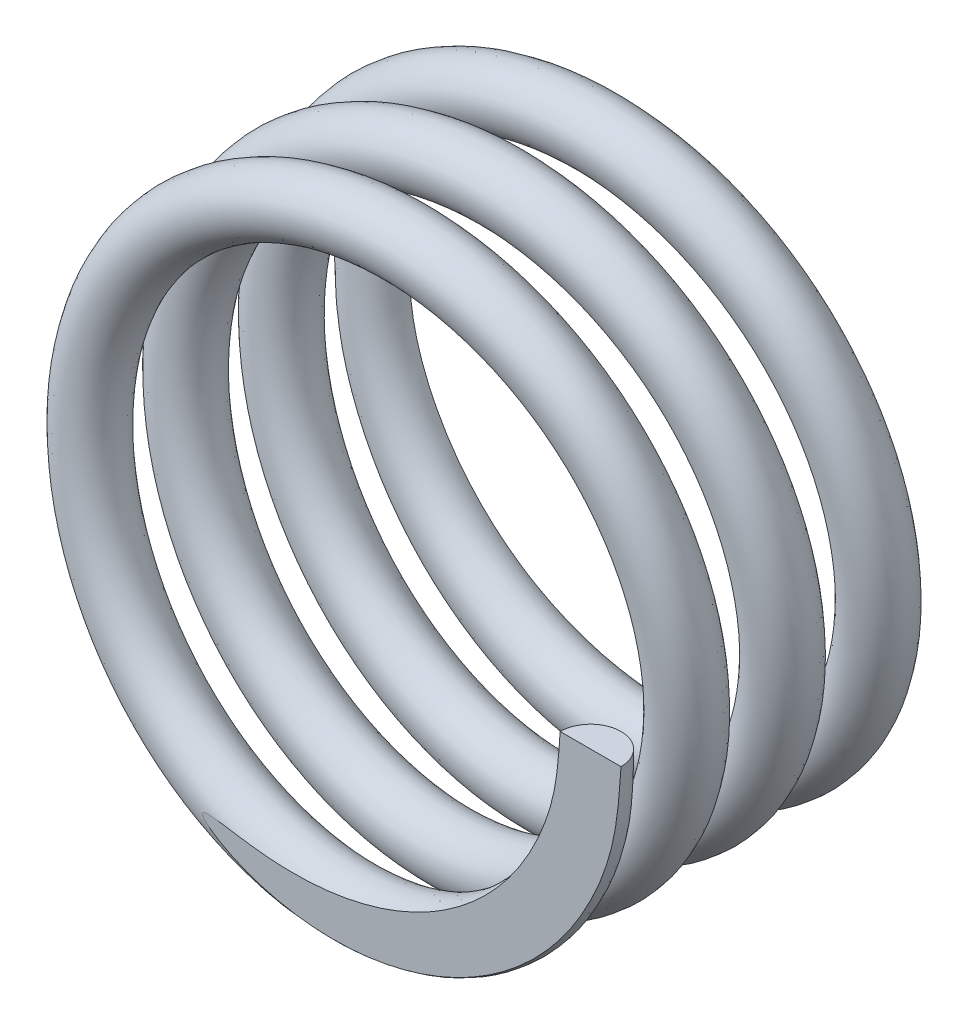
ISO-10303-21;
HEADER;
FILE_DESCRIPTION(('STEP AP214'),'2;1');
FILE_NAME('part.step','',(''),(''),'','','');
FILE_SCHEMA(('AUTOMOTIVE_DESIGN { 1 0 10303 214 1 1 1 1 }'));
ENDSEC;
DATA;
#1=APPLICATION_CONTEXT('core data for automotive mechanical design processes');
#2=APPLICATION_PROTOCOL_DEFINITION('international standard','automotive_design',2000,#1);
#3=PRODUCT_CONTEXT('',#1,'mechanical');
#4=PRODUCT('Part','Part','',(#3));
#5=PRODUCT_RELATED_PRODUCT_CATEGORY('part','',(#4));
#6=PRODUCT_DEFINITION_FORMATION('','',#4);
#7=PRODUCT_DEFINITION_CONTEXT('part definition',#1,'design');
#8=PRODUCT_DEFINITION('design','',#6,#7);
#9=PRODUCT_DEFINITION_SHAPE('','',#8);
#10=(LENGTH_UNIT() NAMED_UNIT(*) SI_UNIT(.MILLI.,.METRE.));
#11=(NAMED_UNIT(*) PLANE_ANGLE_UNIT() SI_UNIT($,.RADIAN.));
#12=(NAMED_UNIT(*) SI_UNIT($,.STERADIAN.) SOLID_ANGLE_UNIT());
#13=UNCERTAINTY_MEASURE_WITH_UNIT(LENGTH_MEASURE(1.E-05),#10,'distance_accuracy_value','');
#14=(GEOMETRIC_REPRESENTATION_CONTEXT(3) GLOBAL_UNCERTAINTY_ASSIGNED_CONTEXT((#13)) GLOBAL_UNIT_ASSIGNED_CONTEXT((#10,
#11,#12)) REPRESENTATION_CONTEXT('',''));
#15=CARTESIAN_POINT('',(0.,0.,0.));
#16=DIRECTION('',(0.,0.,1.));
#17=DIRECTION('',(1.,0.,0.));
#18=AXIS2_PLACEMENT_3D('',#15,#16,#17);
#19=CARTESIAN_POINT('',(4.5,0.,-0.5));
#20=DIRECTION('',(0.,-1.,0.));
#21=DIRECTION('',(0.,0.,-1.));
#22=AXIS2_PLACEMENT_3D('',#19,#20,#21);
#23=PLANE('',#22);
#24=CARTESIAN_POINT('',(4.5,0.,0.));
#25=DIRECTION('',(0.,1.,0.));
#26=DIRECTION('',(0.,0.,1.));
#27=AXIS2_PLACEMENT_3D('',#24,#25,#26);
#28=CIRCLE('',#27,0.500000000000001);
#29=CARTESIAN_POINT('',(4.99999999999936,-1.05609965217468E-11,0.));
#30=VERTEX_POINT('',#29);
#31=CARTESIAN_POINT('',(4.,0.,0.));
#32=VERTEX_POINT('',#31);
#33=EDGE_CURVE('E67',#30,#32,#28,.T.);
#34=ORIENTED_EDGE('',*,*,#33,.T.);
#35=DIRECTION('',(1.,0.,0.));
#36=VECTOR('',#35,1.);
#37=CARTESIAN_POINT('',(4.5,0.,0.));
#38=LINE('',#37,#36);
#39=EDGE_CURVE('E54',#32,#30,#38,.T.);
#40=ORIENTED_EDGE('',*,*,#39,.T.);
#41=EDGE_LOOP('',(#34,#40));
#42=FACE_BOUND('',#41,.T.);
#43=ADVANCED_FACE('F29',(#42),#23,.F.);
#44=CARTESIAN_POINT('',(-4.49993506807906,2.3454502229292E-10,-5.99999999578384));
#45=DIRECTION('',(-7.21756172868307E-06,0.999999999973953,-4.68650668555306E-10));
#46=DIRECTION('',(-0.999999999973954,-7.21756172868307E-06,0.));
#47=AXIS2_PLACEMENT_3D('',#44,#45,#46);
#48=PLANE('',#47);
#49=DIRECTION('',(0.999999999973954,7.21756172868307E-06,0.));
#50=VECTOR('',#49,1.);
#51=CARTESIAN_POINT('',(-4.49993506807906,4.68871469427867E-10,-5.49999999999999));
#52=LINE('',#51,#50);
#53=CARTESIAN_POINT('',(-4.99999999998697,-3.6087806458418E-06,-5.49999999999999));
#54=VERTEX_POINT('',#53);
#55=CARTESIAN_POINT('',(-4.00000000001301,3.60878108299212E-06,-5.49999999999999));
#56=VERTEX_POINT('',#55);
#57=EDGE_CURVE('E48',#54,#56,#52,.T.);
#58=ORIENTED_EDGE('',*,*,#57,.F.);
#59=CARTESIAN_POINT('',(-4.49999999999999,2.18575157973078E-13,-5.49999999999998));
#60=DIRECTION('',(-7.21756172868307E-06,0.999999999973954,-4.68650668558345E-10));
#61=DIRECTION('',(-0.999999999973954,-7.21756172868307E-06,0.));
#62=AXIS2_PLACEMENT_3D('',#59,#60,#61);
#63=CIRCLE('',#62,0.5);
#64=EDGE_CURVE('E64',#54,#56,#63,.T.);
#65=ORIENTED_EDGE('',*,*,#64,.T.);
#66=EDGE_LOOP('',(#58,#65));
#67=FACE_BOUND('',#66,.T.);
#68=ADVANCED_FACE('F31',(#67),#48,.T.);
#69=CARTESIAN_POINT('',(4.5,0.,0.5));
#70=CARTESIAN_POINT('',(4.47688820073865,-0.343023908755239,0.480933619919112));
#71=CARTESIAN_POINT('',(4.43059151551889,-1.03015647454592,0.442740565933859));
#72=CARTESIAN_POINT('',(4.06922277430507,-2.00774351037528,0.385422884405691));
#73=CARTESIAN_POINT('',(3.50973252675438,-2.87997669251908,0.32811877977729));
#74=CARTESIAN_POINT('',(2.76297796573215,-3.60106223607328,0.27083245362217));
#75=CARTESIAN_POINT('',(1.87363456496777,-4.13505056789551,0.213546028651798));
#76=CARTESIAN_POINT('',(0.885529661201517,-4.45188561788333,0.156247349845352));
#77=CARTESIAN_POINT('',(-0.14854098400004,-4.53733501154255,0.0989560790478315));
#78=CARTESIAN_POINT('',(-1.17481656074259,-4.38445174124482,0.0416726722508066));
#79=CARTESIAN_POINT('',(-2.13989818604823,-4.00349758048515,-0.0156317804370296));
#80=CARTESIAN_POINT('',(-2.99310860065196,-3.41295163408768,-0.0729111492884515));
#81=CARTESIAN_POINT('',(-3.68960935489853,-2.6439615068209,-0.130211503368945));
#82=CARTESIAN_POINT('',(-4.19423088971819,-1.73728909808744,-0.187499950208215));
#83=CARTESIAN_POINT('',(-4.47840886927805,-0.739393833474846,-0.24478854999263));
#84=CARTESIAN_POINT('',(-4.52996345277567,0.296903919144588,-0.302088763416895));
#85=CARTESIAN_POINT('',(-4.34382502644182,1.31770225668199,-0.359368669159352));
#86=CARTESIAN_POINT('',(-3.93116315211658,2.26963592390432,-0.416672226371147));
#87=CARTESIAN_POINT('',(-3.31332748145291,3.10330142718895,-0.473955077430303));
#88=CARTESIAN_POINT('',(-2.52176867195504,3.77406581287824,-0.531250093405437));
#89=CARTESIAN_POINT('',(-1.59913799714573,4.24882481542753,-0.588544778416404));
#90=CARTESIAN_POINT('',(-0.59246870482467,4.50029449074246,-0.645827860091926));
#91=CARTESIAN_POINT('',(0.444934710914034,4.51764514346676,-0.703131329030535));
#92=CARTESIAN_POINT('',(1.45919222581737,4.29856999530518,-0.760411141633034));
#93=CARTESIAN_POINT('',(2.39695514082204,3.85465528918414,-0.817711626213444));
#94=CARTESIAN_POINT('',(3.21013167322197,3.2101081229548,-0.874999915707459));
#95=CARTESIAN_POINT('',(3.85455652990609,2.39692370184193,-0.932288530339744));
#96=CARTESIAN_POINT('',(4.29876083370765,1.45923849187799,-0.989588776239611));
#97=CARTESIAN_POINT('',(4.51743382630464,0.444911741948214,-1.04686867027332));
#98=CARTESIAN_POINT('',(4.50047324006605,-0.592479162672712,-1.10417222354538));
#99=CARTESIAN_POINT('',(4.24869749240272,-1.59912114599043,-1.16145507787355));
#100=CARTESIAN_POINT('',(3.77408291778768,-2.52174306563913,-1.21875009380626));
#101=CARTESIAN_POINT('',(3.10336572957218,-3.31343866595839,-1.27604477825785));
#102=CARTESIAN_POINT('',(2.26955785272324,-3.93100201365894,-1.33332786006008));
#103=CARTESIAN_POINT('',(1.31776187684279,-4.34402902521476,-1.39063132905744));
#104=CARTESIAN_POINT('',(0.296873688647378,-4.52976952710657,-1.44791114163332));
#105=CARTESIAN_POINT('',(-0.739385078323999,-4.47851214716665,-1.50521162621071));
#106=CARTESIAN_POINT('',(-1.73731975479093,-4.19421739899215,-1.56249991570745));
#107=CARTESIAN_POINT('',(-2.6438828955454,-3.68954367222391,-1.61978853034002));
#108=CARTESIAN_POINT('',(-3.41311075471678,-2.99322512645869,-1.67708877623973));
#109=CARTESIAN_POINT('',(-4.00330429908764,-2.13979193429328,-1.73436867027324));
#110=CARTESIAN_POINT('',(-4.38462707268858,-1.17487717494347,-1.79167222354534));
#111=CARTESIAN_POINT('',(-4.53724182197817,-0.148510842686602,-1.84895507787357));
#112=CARTESIAN_POINT('',(-4.4518272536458,0.885507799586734,-1.90625009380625));
#113=CARTESIAN_POINT('',(-4.13513416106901,1.8736115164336,-1.96354477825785));
#114=CARTESIAN_POINT('',(-3.60112739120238,2.76325011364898,-2.02082786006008));
#115=CARTESIAN_POINT('',(-2.87984116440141,3.50907386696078,-2.07813132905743));
#116=CARTESIAN_POINT('',(-2.00774327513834,4.07135271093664,-2.13541114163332));
#117=CARTESIAN_POINT('',(-1.03074965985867,4.42055612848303,-2.19271162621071));
#118=CARTESIAN_POINT('',(1.66525471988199E-05,4.53979509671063,-2.24999991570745));
#119=CARTESIAN_POINT('',(1.03070205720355,4.42046406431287,-2.30728853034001));
#120=CARTESIAN_POINT('',(2.00784550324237,4.07152036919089,-2.36458877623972));
#121=CARTESIAN_POINT('',(2.87970798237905,3.50890820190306,-2.42186867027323));
#122=CARTESIAN_POINT('',(3.60126118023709,2.76336911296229,-2.47917222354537));
#123=CARTESIAN_POINT('',(4.13503221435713,1.87353340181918,-2.53645507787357));
#124=CARTESIAN_POINT('',(4.4518212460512,0.885538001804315,-2.59375009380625));
#125=CARTESIAN_POINT('',(4.53736590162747,-0.148543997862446,-2.65104477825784));
#126=CARTESIAN_POINT('',(4.38445792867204,-1.17481843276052,-2.70832786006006));
#127=CARTESIAN_POINT('',(4.00349074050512,-2.13989402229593,-2.76563132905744));
#128=CARTESIAN_POINT('',(3.41295214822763,-2.99310935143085,-2.82291114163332));
#129=CARTESIAN_POINT('',(2.64396210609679,-3.68961051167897,-2.88021162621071));
#130=CARTESIAN_POINT('',(1.73728898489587,-4.19423014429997,-2.93749991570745));
#131=CARTESIAN_POINT('',(0.739393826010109,-4.47840887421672,-2.99478853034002));
#132=CARTESIAN_POINT('',(-0.296903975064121,-4.52996354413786,-3.05208877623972));
#133=CARTESIAN_POINT('',(-1.31770222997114,-4.3438250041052,-3.10936867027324));
#134=CARTESIAN_POINT('',(-2.2696359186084,-3.93116315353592,-3.16667222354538));
#135=CARTESIAN_POINT('',(-3.10330143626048,-3.31332748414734,-3.22395507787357));
#136=CARTESIAN_POINT('',(-3.77406580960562,-2.5217686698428,-3.28125009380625));
#137=CARTESIAN_POINT('',(-4.24882481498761,-1.59913799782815,-3.33854477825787));
#138=CARTESIAN_POINT('',(-4.50029449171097,-0.592468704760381,-3.39582786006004));
#139=CARTESIAN_POINT('',(-4.51764514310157,0.444934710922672,-3.45313132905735));
#140=CARTESIAN_POINT('',(-4.29856999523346,1.45919222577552,-3.51041114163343));
#141=CARTESIAN_POINT('',(-3.85465528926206,2.39695514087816,-3.56771162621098));
#142=CARTESIAN_POINT('',(-3.21010812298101,3.21013167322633,-3.62499991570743));
#143=CARTESIAN_POINT('',(-2.3969237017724,3.85455652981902,-3.68228853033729));
#144=CARTESIAN_POINT('',(-1.45923849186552,4.29876083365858,-3.73958877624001));
#145=CARTESIAN_POINT('',(-0.444911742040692,4.51743382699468,-3.79686867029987));
#146=CARTESIAN_POINT('',(0.592479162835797,4.50047323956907,-3.85417222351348));
#147=CARTESIAN_POINT('',(1.59912114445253,4.2486974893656,-3.91145507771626));
#148=CARTESIAN_POINT('',(2.52174306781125,3.774082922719,-3.96875009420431));
#149=CARTESIAN_POINT('',(3.31343867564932,3.10336573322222,-4.02604477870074));
#150=CARTESIAN_POINT('',(3.93100198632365,2.26955783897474,-4.08332785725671));
#151=CARTESIAN_POINT('',(4.34402901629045,1.31776189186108,-4.14063133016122));
#152=CARTESIAN_POINT('',(4.52976963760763,0.296873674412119,-4.19791115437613));
#153=CARTESIAN_POINT('',(4.47851213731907,-0.739385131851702,-4.25521160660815));
#154=CARTESIAN_POINT('',(4.1942170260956,-1.73731945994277,-4.31249988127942));
#155=CARTESIAN_POINT('',(3.68954368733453,-2.64388293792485,-4.36978865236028));
#156=CARTESIAN_POINT('',(2.99322560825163,-3.41311157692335,-4.4270887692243));
#157=CARTESIAN_POINT('',(2.13979231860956,-4.00330527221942,-4.48436822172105));
#158=CARTESIAN_POINT('',(1.17487616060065,-4.38462142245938,-4.54167275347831));
#159=CARTESIAN_POINT('',(0.148509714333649,-4.53723732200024,-4.59895593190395));
#160=CARTESIAN_POINT('',(-0.885497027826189,-4.45186596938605,-4.65624755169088));
#161=CARTESIAN_POINT('',(-1.87369660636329,-4.13511738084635,-4.71354586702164));
#162=CARTESIAN_POINT('',(-2.76291699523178,-3.60100598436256,-4.77083251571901));
#163=CARTESIAN_POINT('',(-3.50986252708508,-2.88008071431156,-4.82811881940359));
#164=CARTESIAN_POINT('',(-4.06896331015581,-2.0075976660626,-4.88542278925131));
#165=CARTESIAN_POINT('',(-4.43077901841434,-1.03021971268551,-4.94274071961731));
#166=CARTESIAN_POINT('',(-4.47699391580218,-0.343045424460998,-4.98093364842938));
#167=CARTESIAN_POINT('',(-4.50006493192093,-2.34104402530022E-10,-5.00000000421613));
#168=CARTESIAN_POINT('',(5.5,0.,0.500000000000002));
#169=CARTESIAN_POINT('',(5.4718738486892,-0.4191185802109,0.480978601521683));
#170=CARTESIAN_POINT('',(5.41553260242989,-1.25868112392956,0.442875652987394));
#171=CARTESIAN_POINT('',(4.97322370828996,-2.45414118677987,0.385058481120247));
#172=CARTESIAN_POINT('',(4.2900742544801,-3.51956172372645,0.328221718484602));
#173=CARTESIAN_POINT('',(3.37620361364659,-4.40200685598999,0.270685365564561));
#174=CARTESIAN_POINT('',(2.29083980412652,-5.05343030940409,0.213567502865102));
#175=CARTESIAN_POINT('',(1.08228806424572,-5.44144744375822,0.156156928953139));
#176=CARTESIAN_POINT('',(-0.182326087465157,-5.54543546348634,0.0987920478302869));
#177=CARTESIAN_POINT('',(-1.43484612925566,-5.35920755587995,0.0417880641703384));
#178=CARTESIAN_POINT('',(-2.61657724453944,-4.89255253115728,-0.0159173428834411));
#179=CARTESIAN_POINT('',(-3.65730463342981,-4.17213368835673,-0.0727778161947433));
#180=CARTESIAN_POINT('',(-4.5100433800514,-3.23112695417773,-0.130376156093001));
#181=CARTESIAN_POINT('',(-5.12610917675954,-2.12329017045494,-0.187566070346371));
#182=CARTESIAN_POINT('',(-5.47373088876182,-0.904347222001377,-0.244752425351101));
#183=CARTESIAN_POINT('',(-5.53644441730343,0.364065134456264,-0.302349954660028));
#184=CARTESIAN_POINT('',(-5.30954512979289,1.60929019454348,-0.359219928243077));
#185=CARTESIAN_POINT('',(-4.80430237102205,2.77499830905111,-0.416916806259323));
#186=CARTESIAN_POINT('',(-4.05004762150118,3.7922629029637,-0.473894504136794));
#187=CARTESIAN_POINT('',(-3.08229957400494,4.61295371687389,-0.531315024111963));
#188=CARTESIAN_POINT('',(-1.95373217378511,5.19311680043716,-0.588735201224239));
#189=CARTESIAN_POINT('',(-0.725233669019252,5.50036291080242,-0.645713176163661));
#190=CARTESIAN_POINT('',(0.545100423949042,5.52144069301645,-0.703409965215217));
#191=CARTESIAN_POINT('',(1.782299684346,5.25414117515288,-0.760279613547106));
#192=CARTESIAN_POINT('',(2.93023988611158,4.71109144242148,-0.817877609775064));
#193=CARTESIAN_POINT('',(3.92335875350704,3.92334083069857,-0.87506484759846));
#194=CARTESIAN_POINT('',(4.71098919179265,2.93021412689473,-0.932252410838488));
#195=CARTESIAN_POINT('',(5.25432950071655,1.78235315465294,-0.989850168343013));
#196=CARTESIAN_POINT('',(5.521228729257,0.545084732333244,-1.04671989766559));
#197=CARTESIAN_POINT('',(5.50054251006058,-0.725237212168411,-1.10441677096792));
#198=CARTESIAN_POINT('',(5.19299228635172,-1.95370797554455,-1.16139452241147));
#199=CARTESIAN_POINT('',(4.61297445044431,-3.08226853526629,-1.21881502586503));
#200=CARTESIAN_POINT('',(3.7923329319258,-4.05015338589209,-1.27623519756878));
#201=CARTESIAN_POINT('',(2.7749262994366,-4.80413780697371,-1.33321317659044));
#202=CARTESIAN_POINT('',(1.60935675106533,-5.30974694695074,-1.39090996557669));
#203=CARTESIAN_POINT('',(0.364042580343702,-5.5362500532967,-1.44777961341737));
#204=CARTESIAN_POINT('',(-0.904332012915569,-5.47383521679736,-1.50537760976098));
#205=CARTESIAN_POINT('',(-2.1233133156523,-5.12609868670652,-1.56256484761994));
#206=CARTESIAN_POINT('',(-3.23104209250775,-4.50998237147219,-1.61975241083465));
#207=CARTESIAN_POINT('',(-4.17229045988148,-3.65742444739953,-1.67735016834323));
#208=CARTESIAN_POINT('',(-4.89235532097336,-2.61647538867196,-1.73421989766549));
#209=CARTESIAN_POINT('',(-5.35937490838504,-1.43493467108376,-1.79191677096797));
#210=CARTESIAN_POINT('',(-5.54535095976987,-0.182281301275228,-1.8488945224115));
#211=CARTESIAN_POINT('',(-5.44136578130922,1.0823359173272,-1.90631502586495));
#212=CARTESIAN_POINT('',(-5.05358537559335,2.29059083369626,-1.96373519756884));
#213=CARTESIAN_POINT('',(-4.40216155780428,3.37652627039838,-2.02071317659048));
#214=CARTESIAN_POINT('',(-3.51880394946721,4.28969236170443,-2.07840996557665));
#215=CARTESIAN_POINT('',(-2.45496266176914,4.97551504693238,-2.13527961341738));
#216=CARTESIAN_POINT('',(-1.25925221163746,5.40323719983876,-2.192877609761));
#217=CARTESIAN_POINT('',(1.26733688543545E-05,5.54845448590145,-2.25006484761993));
#218=CARTESIAN_POINT('',(1.25919812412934,5.40314668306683,-2.30725241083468));
#219=CARTESIAN_POINT('',(2.45505801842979,4.97568602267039,-2.36485016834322));
#220=CARTESIAN_POINT('',(3.51866516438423,4.28953138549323,-2.42171989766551));
#221=CARTESIAN_POINT('',(4.40229105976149,3.37665075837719,-2.47941677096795));
#222=CARTESIAN_POINT('',(5.05348021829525,2.29051990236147,-2.53639452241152));
#223=CARTESIAN_POINT('',(5.44135849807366,1.08237253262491,-2.59381502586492));
#224=CARTESIAN_POINT('',(5.54547525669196,-0.182306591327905,-2.65123519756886));
#225=CARTESIAN_POINT('',(5.35920762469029,-1.43486921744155,-2.70821317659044));
#226=CARTESIAN_POINT('',(4.89254514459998,-2.61657100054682,-2.76590996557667));
#227=CARTESIAN_POINT('',(4.17213693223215,-3.65730297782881,-2.82277961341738));
#228=CARTESIAN_POINT('',(3.23112670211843,-4.5100452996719,-2.88037760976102));
#229=CARTESIAN_POINT('',(2.12328989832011,-5.12610838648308,-2.93756484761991));
#230=CARTESIAN_POINT('',(0.904347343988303,-5.47373089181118,-2.99475241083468));
#231=CARTESIAN_POINT('',(-0.364065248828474,-5.5364445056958,-3.05235016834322));
#232=CARTESIAN_POINT('',(-1.60929013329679,-5.30954511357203,-3.10921989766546));
#233=CARTESIAN_POINT('',(-2.77499830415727,-4.8043023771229,-3.16691677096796));
#234=CARTESIAN_POINT('',(-3.7922629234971,-4.05004761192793,-3.22389452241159));
#235=CARTESIAN_POINT('',(-4.61295370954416,-3.08229957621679,-3.28131502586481));
#236=CARTESIAN_POINT('',(-5.19311679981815,-1.9537321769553,-3.33873519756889));
#237=CARTESIAN_POINT('',(-5.50036291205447,-0.725233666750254,-3.39571317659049));
#238=CARTESIAN_POINT('',(-5.52144069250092,0.54510042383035,-3.4534099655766));
#239=CARTESIAN_POINT('',(-5.25414117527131,1.782299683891,-3.51027961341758));
#240=CARTESIAN_POINT('',(-4.71109144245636,2.93023988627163,-3.56787760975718));
#241=CARTESIAN_POINT('',(-3.9233408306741,3.92335875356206,-3.6250648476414));
#242=CARTESIAN_POINT('',(-2.93021412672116,4.71098919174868,-3.68225241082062));
#243=CARTESIAN_POINT('',(-1.78235315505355,5.25432950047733,-3.73985016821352));
#244=CARTESIAN_POINT('',(-0.545084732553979,5.52122873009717,-3.79671989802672));
#245=CARTESIAN_POINT('',(0.725237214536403,5.50054250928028,-3.85441677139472));
#246=CARTESIAN_POINT('',(1.95370797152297,5.19299228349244,-3.91139451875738));
#247=CARTESIAN_POINT('',(3.08226853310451,4.61297445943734,-3.96881502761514));
#248=CARTESIAN_POINT('',(4.05015340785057,3.7923329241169,-4.02623521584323));
#249=CARTESIAN_POINT('',(4.80413777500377,2.77492628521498,-4.08321314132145));
#250=CARTESIAN_POINT('',(5.30974693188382,1.60935680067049,-4.14090993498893));
#251=CARTESIAN_POINT('',(5.5362501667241,0.364042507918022,-4.19777982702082));
#252=CARTESIAN_POINT('',(5.47383520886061,-0.904331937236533,-4.25537759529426));
#253=CARTESIAN_POINT('',(5.12609835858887,-2.12331317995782,-4.31256362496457));
#254=CARTESIAN_POINT('',(4.5099816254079,-3.23104298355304,-4.36975386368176));
#255=CARTESIAN_POINT('',(3.65742733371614,-4.17228855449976,-4.42735196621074));
#256=CARTESIAN_POINT('',(2.61647784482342,-4.89235684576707,-4.4842125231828));
#257=CARTESIAN_POINT('',(1.43491245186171,-5.35937537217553,-4.54191800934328));
#258=CARTESIAN_POINT('',(0.182302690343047,-5.54533755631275,-4.59892176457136));
#259=CARTESIAN_POINT('',(-1.08224907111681,-5.44142906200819,-4.65628699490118));
#260=CARTESIAN_POINT('',(-2.29089459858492,-5.0535003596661,-4.71369720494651));
#261=CARTESIAN_POINT('',(-3.37613709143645,-4.40195493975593,-4.77081529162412));
#262=CARTESIAN_POINT('',(-4.29019968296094,-3.51967120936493,-4.8283516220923));
#263=CARTESIAN_POINT('',(-4.97296088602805,-2.45400229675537,-4.88518824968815));
#264=CARTESIAN_POINT('',(-5.41571856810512,-1.25875088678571,-4.94300567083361));
#265=CARTESIAN_POINT('',(-5.47197903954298,-0.419147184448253,-4.98110849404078));
#266=CARTESIAN_POINT('',(-5.50006492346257,-7.21779583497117E-06,-5.00012986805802));
#267=CARTESIAN_POINT('',(5.5,0.,-0.500000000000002));
#268=CARTESIAN_POINT('',(5.47191478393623,-0.419135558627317,-0.519021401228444));
#269=CARTESIAN_POINT('',(5.41565553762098,-1.25873211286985,-0.557124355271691));
#270=CARTESIAN_POINT('',(4.97290630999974,-2.45396450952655,-0.614941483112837));
#271=CARTESIAN_POINT('',(4.29015331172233,-3.51962491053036,-0.671778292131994));
#272=CARTESIAN_POINT('',(3.37610183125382,-4.40189903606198,-0.729314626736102));
#273=CARTESIAN_POINT('',(2.29087750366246,-5.05343643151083,-0.786432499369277));
#274=CARTESIAN_POINT('',(1.0822391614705,-5.44136424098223,-0.843843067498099));
#275=CARTESIAN_POINT('',(-0.182289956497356,-5.54527225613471,-0.901207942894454));
#276=CARTESIAN_POINT('',(-1.43489021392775,-5.35931379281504,-0.958211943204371));
#277=CARTESIAN_POINT('',(-2.61644025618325,-4.89230232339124,-1.01591732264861));
#278=CARTESIAN_POINT('',(-3.65737748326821,-4.17224551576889,-1.07277782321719));
#279=CARTESIAN_POINT('',(-4.50992593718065,-3.23100797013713,-1.1303761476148));
#280=CARTESIAN_POINT('',(-5.12603364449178,-2.12329827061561,-1.18756606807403));
#281=CARTESIAN_POINT('',(-5.4737700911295,-0.904325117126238,-1.2447524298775));
#282=CARTESIAN_POINT('',(-5.53618514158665,0.364028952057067,-1.30234993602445));
#283=CARTESIAN_POINT('',(-5.30968666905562,1.60933085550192,-1.35921993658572));
#284=CARTESIAN_POINT('',(-4.80408362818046,2.7748885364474,-1.41691679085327));
#285=CARTESIAN_POINT('',(-4.05011287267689,3.79228064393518,-1.47389450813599));
#286=CARTESIAN_POINT('',(-3.0822348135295,4.61291820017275,-1.53131502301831));
#287=CARTESIAN_POINT('',(-1.95369471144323,5.19292711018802,-1.58873518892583));
#288=CARTESIAN_POINT('',(-0.72523412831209,5.50047710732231,-1.64571318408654));
#289=CARTESIAN_POINT('',(0.545070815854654,5.52116397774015,-1.7034099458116));
#290=CARTESIAN_POINT('',(1.78232355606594,5.25427066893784,-1.7602796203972));
#291=CARTESIAN_POINT('',(2.9301760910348,4.71093552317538,-1.81787760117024));
#292=CARTESIAN_POINT('',(3.92328674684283,3.92332021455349,-1.87506484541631));
#293=CARTESIAN_POINT('',(4.71103389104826,2.93020866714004,-1.93225241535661));
#294=CARTESIAN_POINT('',(5.25407591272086,1.78228732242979,-1.98985014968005));
#295=CARTESIAN_POINT('',(5.52137508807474,0.54510133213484,-2.04671990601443));
#296=CARTESIAN_POINT('',(5.50029844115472,-0.725219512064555,-2.10441675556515));
#297=CARTESIAN_POINT('',(5.19305934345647,-1.95369938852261,-2.16139452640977));
#298=CARTESIAN_POINT('',(4.61290102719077,-3.08226050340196,-2.21881502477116));
#299=CARTESIAN_POINT('',(3.79222573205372,-4.04999247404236,-2.27623518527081));
#300=CARTESIAN_POINT('',(2.77497042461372,-4.80424313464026,-2.33321318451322));
#301=CARTESIAN_POINT('',(1.60927821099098,-5.3094799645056,-2.39090994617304));
#302=CARTESIAN_POINT('',(0.36407008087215,-5.53637882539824,-2.44777962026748));
#303=CARTESIAN_POINT('',(-0.904332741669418,-5.47366675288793,-2.50537760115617));
#304=CARTESIAN_POINT('',(-2.12325467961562,-5.1260520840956,-2.56256484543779));
#305=CARTESIAN_POINT('',(-3.23108547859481,-4.50999443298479,-2.61975241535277));
#306=CARTESIAN_POINT('',(-4.17208136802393,-3.65726658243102,-2.67735014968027));
#307=CARTESIAN_POINT('',(-4.89248418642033,-2.61654673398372,-2.73421990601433));
#308=CARTESIAN_POINT('',(-5.35914264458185,-1.43485762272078,-2.7919167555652));
#309=CARTESIAN_POINT('',(-5.54540962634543,-0.182314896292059,-2.8488945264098));
#310=CARTESIAN_POINT('',(-5.44129487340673,1.08235659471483,-2.90631502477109));
#311=CARTESIAN_POINT('',(-5.05342475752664,2.29048319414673,-2.96373518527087));
#312=CARTESIAN_POINT('',(-4.40224263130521,3.37660669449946,-3.02071318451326));
#313=CARTESIAN_POINT('',(-3.51862921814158,4.28947575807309,-3.07840994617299));
#314=CARTESIAN_POINT('',(-2.45503734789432,4.97562349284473,-3.13527962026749));
#315=CARTESIAN_POINT('',(-1.2591870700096,5.40308183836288,-3.19287760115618));
#316=CARTESIAN_POINT('',(-2.36652181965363E-05,5.5483889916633,-3.25006484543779));
#317=CARTESIAN_POINT('',(1.25923359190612,5.40317442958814,-3.3072524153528));
#318=CARTESIAN_POINT('',(2.45492525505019,4.97546015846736,-3.36485014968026));
#319=CARTESIAN_POINT('',(3.51875691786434,4.28964661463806,-3.42171990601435));
#320=CARTESIAN_POINT('',(4.40210596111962,3.37649069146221,-3.47941675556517));
#321=CARTESIAN_POINT('',(5.05352156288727,2.2905733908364,-3.53639452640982));
#322=CARTESIAN_POINT('',(5.44130090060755,1.08232629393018,-3.59381502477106));
#323=CARTESIAN_POINT('',(5.54528567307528,-0.18226861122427,-3.65123518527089));
#324=CARTESIAN_POINT('',(5.35931330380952,-1.43491249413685,-3.70821318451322));
#325=CARTESIAN_POINT('',(4.89230082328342,-2.61643775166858,-3.76590994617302));
#326=CARTESIAN_POINT('',(4.17224743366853,-3.65737458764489,-3.82277962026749));
#327=CARTESIAN_POINT('',(3.23100706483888,-4.50992669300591,-3.8803776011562));
#328=CARTESIAN_POINT('',(2.12329840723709,-5.12603397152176,-3.93756484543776));
#329=CARTESIAN_POINT('',(0.904325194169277,-5.47377009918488,-3.99475241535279));
#330=CARTESIAN_POINT('',(-0.364029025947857,-5.5361850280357,-4.05235014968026));
#331=CARTESIAN_POINT('',(-1.60933080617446,-5.30968668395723,-4.10921990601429));
#332=CARTESIAN_POINT('',(-2.77488855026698,-4.80408366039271,-4.16691675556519));
#333=CARTESIAN_POINT('',(-3.79228065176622,-4.05011285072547,-4.22389452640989));
#334=CARTESIAN_POINT('',(-4.61291819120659,-3.08223481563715,-4.28131502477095));
#335=CARTESIAN_POINT('',(-5.19292711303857,-1.95369471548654,-4.33873518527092));
#336=CARTESIAN_POINT('',(-5.50047710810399,-0.725234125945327,-4.39571318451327));
#337=CARTESIAN_POINT('',(-5.52116397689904,0.54507081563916,-4.45340994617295));
#338=CARTESIAN_POINT('',(-5.254270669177,1.78232355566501,-4.51027962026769));
#339=CARTESIAN_POINT('',(-4.7109355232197,2.9301760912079,-4.56787760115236));
#340=CARTESIAN_POINT('',(-3.92332021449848,3.92328674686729,-4.62506484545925));
#341=CARTESIAN_POINT('',(-2.93020866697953,4.71103389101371,-4.68225241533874));
#342=CARTESIAN_POINT('',(-1.78228732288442,5.25407591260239,-4.73985014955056));
#343=CARTESIAN_POINT('',(-0.545101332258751,5.5213750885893,-4.79671990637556));
#344=CARTESIAN_POINT('',(0.725219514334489,5.50029843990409,-4.854416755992));
#345=CARTESIAN_POINT('',(1.95369938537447,5.19305934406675,-4.91139452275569));
#346=CARTESIAN_POINT('',(3.08226050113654,4.61290103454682,-4.96881502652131));
#347=CARTESIAN_POINT('',(4.04999248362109,3.79222571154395,-5.02623520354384));
#348=CARTESIAN_POINT('',(4.80424312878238,2.7749704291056,-5.08321314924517));
#349=CARTESIAN_POINT('',(5.30947998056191,1.60927827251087,-5.1409099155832));
#350=CARTESIAN_POINT('',(5.53637873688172,0.364069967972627,-5.19777983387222));
#351=CARTESIAN_POINT('',(5.47366674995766,-0.904332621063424,-5.25537758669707));
#352=CARTESIAN_POINT('',(5.12605287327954,-2.12325495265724,-5.31256362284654));
#353=CARTESIAN_POINT('',(4.50999252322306,-3.23108571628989,-5.36975386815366));
#354=CARTESIAN_POINT('',(3.65726822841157,-4.17207813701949,-5.42735194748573));
#355=CARTESIAN_POINT('',(2.61655292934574,-4.89249159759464,-5.48421253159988));
#356=CARTESIAN_POINT('',(1.43483459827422,-5.35914254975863,-5.54191799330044));
#357=CARTESIAN_POINT('',(0.182334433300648,-5.5453698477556,-5.59892176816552));
#358=CARTESIAN_POINT('',(-1.08227242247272,-5.44138375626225,-5.6562869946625));
#359=CARTESIAN_POINT('',(-2.29080271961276,-5.05337497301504,-5.71369719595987));
#360=CARTESIAN_POINT('',(-3.37615923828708,-4.40195874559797,-5.77081529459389));
#361=CARTESIAN_POINT('',(-4.29001928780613,-3.51952496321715,-5.82835161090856));
#362=CARTESIAN_POINT('',(-4.97316088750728,-2.45412100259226,-5.88518825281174));
#363=CARTESIAN_POINT('',(-5.41546772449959,-1.25867022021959,-5.94300565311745));
#364=CARTESIAN_POINT('',(-5.47180889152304,-0.419120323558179,-5.98110848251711));
#365=CARTESIAN_POINT('',(-5.4999350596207,-7.21732716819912E-06,-6.00012985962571));
#366=CARTESIAN_POINT('',(4.5,0.,-0.5));
#367=CARTESIAN_POINT('',(4.47692913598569,-0.343040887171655,-0.519066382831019));
#368=CARTESIAN_POINT('',(4.43071445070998,-1.03020746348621,-0.557259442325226));
#369=CARTESIAN_POINT('',(4.06890537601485,-2.00756683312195,-0.614577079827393));
#370=CARTESIAN_POINT('',(3.5098115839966,-2.88003987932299,-0.671881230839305));
#371=CARTESIAN_POINT('',(2.76287618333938,-3.60095441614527,-0.729167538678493));
#372=CARTESIAN_POINT('',(1.87367226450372,-4.13505669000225,-0.786453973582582));
#373=CARTESIAN_POINT('',(0.885480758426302,-4.45180241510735,-0.843752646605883));
#374=CARTESIAN_POINT('',(-0.148504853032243,-4.53717180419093,-0.901043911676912));
#375=CARTESIAN_POINT('',(-1.17486064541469,-4.38455797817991,-0.958327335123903));
#376=CARTESIAN_POINT('',(-2.13976119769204,-4.00324737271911,-1.01563176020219));
#377=CARTESIAN_POINT('',(-2.99318145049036,-3.41306346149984,-1.0729111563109));
#378=CARTESIAN_POINT('',(-3.68949191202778,-2.64384252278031,-1.13021149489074));
#379=CARTESIAN_POINT('',(-4.19415535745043,-1.73729719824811,-1.18749994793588));
#380=CARTESIAN_POINT('',(-4.47844807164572,-0.739371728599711,-1.24478855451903));
#381=CARTESIAN_POINT('',(-4.52970417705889,0.29686773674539,-1.30208874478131));
#382=CARTESIAN_POINT('',(-4.34396656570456,1.31774291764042,-1.359368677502));
#383=CARTESIAN_POINT('',(-3.93094440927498,2.2695261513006,-1.4166722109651));
#384=CARTESIAN_POINT('',(-3.31339273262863,3.10331916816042,-1.47395508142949));
#385=CARTESIAN_POINT('',(-2.5217039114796,3.7740302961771,-1.53125009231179));
#386=CARTESIAN_POINT('',(-1.59910053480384,4.24863512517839,-1.588544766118));
#387=CARTESIAN_POINT('',(-0.592469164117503,4.50040868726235,-1.64582786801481));
#388=CARTESIAN_POINT('',(0.444905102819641,4.51736842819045,-1.70313130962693));
#389=CARTESIAN_POINT('',(1.45921609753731,4.29869948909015,-1.76041114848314));
#390=CARTESIAN_POINT('',(2.39689134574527,3.85449936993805,-1.81771161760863));
#391=CARTESIAN_POINT('',(3.21005966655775,3.21008750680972,-1.87499991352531));
#392=CARTESIAN_POINT('',(3.85460122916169,2.39691824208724,-1.93228853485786));
#393=CARTESIAN_POINT('',(4.29850724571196,1.45917265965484,-1.98958875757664));
#394=CARTESIAN_POINT('',(4.51758018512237,0.44492834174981,-2.04686867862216));
#395=CARTESIAN_POINT('',(4.50022917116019,-0.592461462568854,-2.10417220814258));
#396=CARTESIAN_POINT('',(4.24876454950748,-1.59911255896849,-2.16145508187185));
#397=CARTESIAN_POINT('',(3.77400949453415,-2.52173503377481,-2.2187500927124));
#398=CARTESIAN_POINT('',(3.10325852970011,-3.31327775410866,-2.27604476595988));
#399=CARTESIAN_POINT('',(2.26960197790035,-3.9311073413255,-2.33332786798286));
#400=CARTESIAN_POINT('',(1.31768333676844,-4.34376204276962,-2.39063130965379));
#401=CARTESIAN_POINT('',(0.296901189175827,-4.52989829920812,-2.44791114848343));
#402=CARTESIAN_POINT('',(-0.739385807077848,-4.47834368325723,-2.50521161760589));
#403=CARTESIAN_POINT('',(-1.73726111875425,-4.19417079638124,-2.5624999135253));
#404=CARTESIAN_POINT('',(-2.64392628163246,-3.68955573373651,-2.61978853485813));
#405=CARTESIAN_POINT('',(-3.41290166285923,-2.99306726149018,-2.67708875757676));
#406=CARTESIAN_POINT('',(-4.00343316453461,-2.13986327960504,-2.73436867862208));
#407=CARTESIAN_POINT('',(-4.38439480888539,-1.17480012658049,-2.79167220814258));
#408=CARTESIAN_POINT('',(-4.53730048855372,-0.148544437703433,-2.84895508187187));
#409=CARTESIAN_POINT('',(-4.45175634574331,0.885528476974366,-2.90625009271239));
#410=CARTESIAN_POINT('',(-4.1349735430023,1.87350387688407,-2.96354476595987));
#411=CARTESIAN_POINT('',(-3.60120846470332,2.76333053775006,-3.02082786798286));
#412=CARTESIAN_POINT('',(-2.87966643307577,3.50885726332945,-3.07813130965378));
#413=CARTESIAN_POINT('',(-2.00781796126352,4.07146115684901,-3.13541114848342));
#414=CARTESIAN_POINT('',(-1.03068451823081,4.42040076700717,-3.19271161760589));
#415=CARTESIAN_POINT('',(-1.96860398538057E-05,4.5397296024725,-3.2499999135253));
#416=CARTESIAN_POINT('',(1.03073752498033,4.42049181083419,-3.30728853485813));
#417=CARTESIAN_POINT('',(2.00771273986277,4.07129450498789,-3.36458875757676));
#418=CARTESIAN_POINT('',(2.87979973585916,3.50902343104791,-3.42186867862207));
#419=CARTESIAN_POINT('',(3.60107608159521,2.76320904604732,-3.47917220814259));
#420=CARTESIAN_POINT('',(4.13507355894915,1.87358689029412,-3.53645508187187));
#421=CARTESIAN_POINT('',(4.45176364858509,0.885491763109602,-3.59375009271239));
#422=CARTESIAN_POINT('',(4.53717631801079,-0.148506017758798,-3.65104476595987));
#423=CARTESIAN_POINT('',(4.38456360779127,-1.17486170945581,-3.70832786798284));
#424=CARTESIAN_POINT('',(4.00324641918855,-2.13976077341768,-3.76563130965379));
#425=CARTESIAN_POINT('',(3.41306264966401,-2.99318096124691,-3.82291114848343));
#426=CARTESIAN_POINT('',(2.64384246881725,-3.68949190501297,-3.88021161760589));
#427=CARTESIAN_POINT('',(1.73729749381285,-4.19415572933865,-3.9374999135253));
#428=CARTESIAN_POINT('',(0.739371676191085,-4.47844808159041,-3.99478853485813));
#429=CARTESIAN_POINT('',(-0.296867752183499,-4.52970406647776,-4.05208875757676));
#430=CARTESIAN_POINT('',(-1.31774290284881,-4.3439665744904,-4.10936867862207));
#431=CARTESIAN_POINT('',(-2.26952616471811,-3.93094443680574,-4.1666722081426));
#432=CARTESIAN_POINT('',(-3.1033191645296,-3.31339272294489,-4.22395508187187));
#433=CARTESIAN_POINT('',(-3.77403029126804,-2.52170390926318,-4.28125009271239));
#434=CARTESIAN_POINT('',(-4.24863512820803,-1.59910053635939,-4.3385447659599));
#435=CARTESIAN_POINT('',(-4.5004086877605,-0.592469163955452,-4.39582786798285));
#436=CARTESIAN_POINT('',(-4.51736842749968,0.444905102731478,-4.45313130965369));
#437=CARTESIAN_POINT('',(-4.29869948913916,1.45921609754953,-4.51041114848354));
#438=CARTESIAN_POINT('',(-3.8544993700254,2.39689134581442,-4.56771161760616));
#439=CARTESIAN_POINT('',(-3.21008750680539,3.21005966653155,-4.62499991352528));
#440=CARTESIAN_POINT('',(-2.39691824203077,3.85460122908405,-4.68228853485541));
#441=CARTESIAN_POINT('',(-1.45917265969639,4.29850724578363,-4.73958875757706));
#442=CARTESIAN_POINT('',(-0.444928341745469,4.51758018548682,-4.79686867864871));
#443=CARTESIAN_POINT('',(0.592461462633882,4.50022917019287,-4.85417220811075));
#444=CARTESIAN_POINT('',(1.59911255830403,4.2487645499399,-4.91145508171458));
#445=CARTESIAN_POINT('',(2.52173503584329,3.77400949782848,-4.96875009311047));
#446=CARTESIAN_POINT('',(3.31327775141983,3.10325852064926,-5.02604476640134));
#447=CARTESIAN_POINT('',(3.93110734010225,2.26960198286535,-5.08332786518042));
#448=CARTESIAN_POINT('',(4.34376206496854,1.31768336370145,-5.14063131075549));
#449=CARTESIAN_POINT('',(4.52989820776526,0.296901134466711,-5.19791116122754));
#450=CARTESIAN_POINT('',(4.47834367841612,-0.739385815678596,-5.25521159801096));
#451=CARTESIAN_POINT('',(4.19417154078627,-1.7372612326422,-5.3124998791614));
#452=CARTESIAN_POINT('',(3.6895545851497,-2.64392567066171,-5.36978865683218));
#453=CARTESIAN_POINT('',(2.99306650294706,-3.4129011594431,-5.4270887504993));
#454=CARTESIAN_POINT('',(2.13986740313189,-4.00344002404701,-5.48436823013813));
#455=CARTESIAN_POINT('',(1.17479830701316,-4.3843886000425,-5.54167273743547));
#456=CARTESIAN_POINT('',(0.148541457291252,-4.5372696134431,-5.59895593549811));
#457=CARTESIAN_POINT('',(-0.885520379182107,-4.45182066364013,-5.6562475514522));
#458=CARTESIAN_POINT('',(-1.87360472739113,-4.1349919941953,-5.713545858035));
#459=CARTESIAN_POINT('',(-2.7629391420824,-3.60100979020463,-5.77083251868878));
#460=CARTESIAN_POINT('',(-3.50968213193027,-2.87993446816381,-5.82811880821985));
#461=CARTESIAN_POINT('',(-4.06916331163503,-2.00771637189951,-5.8854227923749));
#462=CARTESIAN_POINT('',(-4.43052817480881,-1.03013904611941,-5.94274070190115));
#463=CARTESIAN_POINT('',(-4.47682376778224,-0.34301856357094,-5.98093363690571));
#464=CARTESIAN_POINT('',(-4.49993506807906,2.3454502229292E-10,-5.99999999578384));
#465=CARTESIAN_POINT('',(3.5,0.,-0.500000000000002));
#466=CARTESIAN_POINT('',(3.48194348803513,-0.266946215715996,-0.51911136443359));
#467=CARTESIAN_POINT('',(3.44577336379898,-0.801682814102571,-0.557394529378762));
#468=CARTESIAN_POINT('',(3.16490444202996,-1.56116915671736,-0.614212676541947));
#469=CARTESIAN_POINT('',(2.72946985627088,-2.24045484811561,-0.671984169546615));
#470=CARTESIAN_POINT('',(2.14965053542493,-2.80000979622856,-0.729020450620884));
#471=CARTESIAN_POINT('',(1.45646702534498,-3.21667694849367,-0.786475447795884));
#472=CARTESIAN_POINT('',(0.688722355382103,-3.46224058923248,-0.843662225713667));
#473=CARTESIAN_POINT('',(-0.114719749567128,-3.52907135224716,-0.900879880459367));
#474=CARTESIAN_POINT('',(-0.91483107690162,-3.40980216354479,-0.958442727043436));
#475=CARTESIAN_POINT('',(-1.66308213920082,-3.11419242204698,-1.01534619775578));
#476=CARTESIAN_POINT('',(-2.3289854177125,-2.65388140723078,-1.07304448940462));
#477=CARTESIAN_POINT('',(-2.86905788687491,-2.05667707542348,-1.13004684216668));
#478=CARTESIAN_POINT('',(-3.26227707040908,-1.35129612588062,-1.18743382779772));
#479=CARTESIAN_POINT('',(-3.48312605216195,-0.574418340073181,-1.24482467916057));
#480=CARTESIAN_POINT('',(-3.52322321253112,0.229706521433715,-1.30182755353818));
#481=CARTESIAN_POINT('',(-3.37824646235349,1.02615497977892,-1.35951741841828));
#482=CARTESIAN_POINT('',(-3.05780519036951,1.76416376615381,-1.41642763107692));
#483=CARTESIAN_POINT('',(-2.57667259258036,2.41435769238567,-1.47401565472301));
#484=CARTESIAN_POINT('',(-1.9611730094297,2.93514239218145,-1.53118516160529));
#485=CARTESIAN_POINT('',(-1.24450635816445,3.30434314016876,-1.58835434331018));
#486=CARTESIAN_POINT('',(-0.459704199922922,3.50034026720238,-1.6459425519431));
#487=CARTESIAN_POINT('',(0.34473938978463,3.51357287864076,-1.70285267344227));
#488=CARTESIAN_POINT('',(1.13610863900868,3.34312830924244,-1.76054267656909));
#489=CARTESIAN_POINT('',(1.86360660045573,2.99806321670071,-1.81754563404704));
#490=CARTESIAN_POINT('',(2.49683258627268,2.49685479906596,-1.8749349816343));
#491=CARTESIAN_POINT('',(2.99816856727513,1.86362781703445,-1.93232465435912));
#492=CARTESIAN_POINT('',(3.34293857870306,1.13605799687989,-1.98932736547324));
#493=CARTESIAN_POINT('',(3.51378528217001,0.344755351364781,-2.04701745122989));
#494=CARTESIAN_POINT('',(3.50015990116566,-0.459703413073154,-2.10392766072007));
#495=CARTESIAN_POINT('',(3.30446975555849,-1.24452572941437,-2.16151563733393));
#496=CARTESIAN_POINT('',(2.93511796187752,-1.96120956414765,-2.21868516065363));
#497=CARTESIAN_POINT('',(2.41429132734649,-2.57656303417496,-2.27585434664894));
#498=CARTESIAN_POINT('',(1.76423353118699,-3.05797154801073,-2.3334425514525));
#499=CARTESIAN_POINT('',(1.02608846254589,-3.37804412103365,-2.39035267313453));
#500=CARTESIAN_POINT('',(0.229732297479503,-3.52341777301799,-2.44804267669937));
#501=CARTESIAN_POINT('',(-0.574438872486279,-3.48302061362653,-2.50504563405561));
#502=CARTESIAN_POINT('',(-1.35126755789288,-3.26228950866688,-2.5624349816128));
#503=CARTESIAN_POINT('',(-2.05676708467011,-2.86911703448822,-2.61982465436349));
#504=CARTESIAN_POINT('',(-2.65372195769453,-2.32886794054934,-2.67682736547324));
#505=CARTESIAN_POINT('',(-3.11438214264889,-1.66317982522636,-2.73451745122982));
#506=CARTESIAN_POINT('',(-3.40964697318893,-0.9147426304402,-2.79142766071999));
#507=CARTESIAN_POINT('',(-3.52919135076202,-0.114773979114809,-2.84901563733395));
#508=CARTESIAN_POINT('',(-3.46221781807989,0.688700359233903,-2.9061851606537));
#509=CARTESIAN_POINT('',(-3.21652232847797,1.4565245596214,-2.96335434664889));
#510=CARTESIAN_POINT('',(-2.80017429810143,2.15005438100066,-3.02094255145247));
#511=CARTESIAN_POINT('',(-2.24070364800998,2.72823876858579,-3.07785267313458));
#512=CARTESIAN_POINT('',(-1.56059857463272,3.16729882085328,-3.13554267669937));
#513=CARTESIAN_POINT('',(-0.80218196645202,3.43771969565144,-3.19254563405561));
#514=CARTESIAN_POINT('',(-1.57068615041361E-05,3.53107021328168,-3.24993498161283));
#515=CARTESIAN_POINT('',(0.802241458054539,3.43780919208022,-3.30732465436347));
#516=CARTESIAN_POINT('',(1.56050022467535,3.16712885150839,-3.36432736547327));
#517=CARTESIAN_POINT('',(2.24084255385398,2.72840024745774,-3.4220174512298));
#518=CARTESIAN_POINT('',(2.80004620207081,2.14992740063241,-3.47892766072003));
#519=CARTESIAN_POINT('',(3.21662555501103,1.45660038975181,-3.53651563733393));
#520=CARTESIAN_POINT('',(3.46222639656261,0.688657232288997,-3.59368516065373));
#521=CARTESIAN_POINT('',(3.5290669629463,-0.114743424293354,-3.65085434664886));
#522=CARTESIAN_POINT('',(3.40981391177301,-0.914810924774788,-3.70844255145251));
#523=CARTESIAN_POINT('',(3.11419201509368,-1.66308379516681,-3.76535267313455));
#524=CARTESIAN_POINT('',(2.65387786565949,-2.32898733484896,-3.82304267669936));
#525=CARTESIAN_POINT('',(2.05667787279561,-2.86905711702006,-3.88004563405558));
#526=CARTESIAN_POINT('',(1.35129658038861,-3.26227748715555,-3.93743498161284));
#527=CARTESIAN_POINT('',(0.574418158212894,-3.48312606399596,-3.99482465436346));
#528=CARTESIAN_POINT('',(-0.229706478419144,-3.52322310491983,-4.05182736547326));
#529=CARTESIAN_POINT('',(-1.02615499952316,-3.37824646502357,-4.10951745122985));
#530=CARTESIAN_POINT('',(-1.76416377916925,-3.05780521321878,-4.16642766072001));
#531=CARTESIAN_POINT('',(-2.41435767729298,-2.57667259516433,-4.22401563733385));
#532=CARTESIAN_POINT('',(-2.9351423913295,-1.96117300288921,-4.28118516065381));
#533=CARTESIAN_POINT('',(-3.30434314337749,-1.24450635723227,-4.33835434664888));
#534=CARTESIAN_POINT('',(-3.500340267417,-0.459704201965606,-4.39594255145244));
#535=CARTESIAN_POINT('',(-3.51357287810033,0.34473938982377,-4.45285267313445));
#536=CARTESIAN_POINT('',(-3.34312830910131,1.13610863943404,-4.5105426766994));
#537=CARTESIAN_POINT('',(-2.9980632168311,1.86360660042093,-4.56754563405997));
#538=CARTESIAN_POINT('',(-2.4968547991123,2.4968325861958,-4.62493498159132));
#539=CARTESIAN_POINT('',(-1.863627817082,2.99816856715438,-4.68232465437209));
#540=CARTESIAN_POINT('',(-1.13605799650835,3.34293857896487,-4.73932736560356));
#541=CARTESIAN_POINT('',(-0.344755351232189,3.51378528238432,-4.79701745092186));
#542=CARTESIAN_POINT('',(0.459703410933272,3.50015990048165,-4.85392766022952));
#543=CARTESIAN_POINT('',(1.24452573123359,3.30446975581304,-4.91151564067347));
#544=CARTESIAN_POINT('',(1.96120957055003,2.93511796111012,-4.96868515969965));
#545=CARTESIAN_POINT('',(2.57656301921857,2.41429132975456,-5.02585432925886));
#546=CARTESIAN_POINT('',(3.05797155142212,1.7642335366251,-5.08344258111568));
#547=CARTESIAN_POINT('',(3.37804414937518,1.02608845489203,-5.14035270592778));
#548=CARTESIAN_POINT('',(3.52341767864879,0.229732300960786,-5.19804248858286));
#549=CARTESIAN_POINT('',(3.48302060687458,-0.574439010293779,-5.25504560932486));
#550=CARTESIAN_POINT('',(3.262290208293,-1.35126751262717,-5.31243613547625));
#551=CARTESIAN_POINT('',(2.86911664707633,-2.05676562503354,-5.3698234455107));
#552=CARTESIAN_POINT('',(2.32886477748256,-2.65372418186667,-5.42682555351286));
#553=CARTESIAN_POINT('',(1.66318187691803,-3.11438845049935,-5.48452392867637));
#554=CARTESIAN_POINT('',(0.914762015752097,-3.40963465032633,-5.54142748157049));
#555=CARTESIAN_POINT('',(0.114748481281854,-3.52916937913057,-5.59899010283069));
#556=CARTESIAN_POINT('',(-0.688768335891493,-3.46225757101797,-5.65620810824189));
#557=CARTESIAN_POINT('',(-1.45640673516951,-3.21660901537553,-5.71339452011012));
#558=CARTESIAN_POINT('',(-2.14971904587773,-2.80006083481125,-5.77084974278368));
#559=CARTESIAN_POINT('',(-2.72934497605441,-2.24034397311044,-5.82788600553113));
#560=CARTESIAN_POINT('',(-3.16516573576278,-1.56131174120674,-5.88565733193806));
#561=CARTESIAN_POINT('',(-3.44558862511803,-0.801607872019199,-5.94247575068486));
#562=CARTESIAN_POINT('',(-3.48183864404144,-0.266916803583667,-5.98075879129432));
#563=CARTESIAN_POINT('',(-3.49993507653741,7.21779629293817E-06,-5.99987013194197));
#564=CARTESIAN_POINT('',(3.5,0.,0.500000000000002));
#565=CARTESIAN_POINT('',(3.4819025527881,-0.266929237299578,0.480888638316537));
#566=CARTESIAN_POINT('',(3.44565042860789,-0.801631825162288,0.442605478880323));
#567=CARTESIAN_POINT('',(3.16522184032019,-1.56134583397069,0.385787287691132));
#568=CARTESIAN_POINT('',(2.72939079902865,-2.2403916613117,0.32801584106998));
#569=CARTESIAN_POINT('',(2.1497523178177,-2.80011761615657,0.270979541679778));
#570=CARTESIAN_POINT('',(1.45642932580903,-3.21667082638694,0.213524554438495));
#571=CARTESIAN_POINT('',(0.688771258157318,-3.46232379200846,0.156337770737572));
#572=CARTESIAN_POINT('',(-0.114755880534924,-3.52923455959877,0.0991201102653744));
#573=CARTESIAN_POINT('',(-0.914786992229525,-3.40969592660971,0.0415572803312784));
#574=CARTESIAN_POINT('',(-1.66321912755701,-3.11444262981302,-0.0153462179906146));
#575=CARTESIAN_POINT('',(-2.3289125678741,-2.65376957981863,-0.0730444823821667));
#576=CARTESIAN_POINT('',(-2.86917532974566,-2.05679605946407,-0.130046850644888));
#577=CARTESIAN_POINT('',(-3.26235260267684,-1.35128802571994,-0.187433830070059));
#578=CARTESIAN_POINT('',(-3.48308684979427,-0.57444044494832,-0.244824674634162));
#579=CARTESIAN_POINT('',(-3.5234824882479,0.229742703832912,-0.301827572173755));
#580=CARTESIAN_POINT('',(-3.37810492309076,1.02611431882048,-0.35951741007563));
#581=CARTESIAN_POINT('',(-3.05802393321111,1.76427353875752,-0.416427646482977));
#582=CARTESIAN_POINT('',(-2.57660734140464,2.41433995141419,-0.474015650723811));
#583=CARTESIAN_POINT('',(-1.96123776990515,2.93517790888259,-0.531185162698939));
#584=CARTESIAN_POINT('',(-1.24454382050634,3.3045328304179,-0.588354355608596));
#585=CARTESIAN_POINT('',(-0.459703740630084,3.5002260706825,-0.645942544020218));
#586=CARTESIAN_POINT('',(0.344768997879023,3.51384959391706,-0.702852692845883));
#587=CARTESIAN_POINT('',(1.13608476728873,3.34299881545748,-0.760542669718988));
#588=CARTESIAN_POINT('',(1.8636703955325,2.99821913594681,-0.817545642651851));
#589=CARTESIAN_POINT('',(2.4969045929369,2.49687541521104,-0.874934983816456));
#590=CARTESIAN_POINT('',(2.99812386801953,1.86363327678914,-0.932324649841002));
#591=CARTESIAN_POINT('',(3.34319216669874,1.13612382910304,-0.989327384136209));
#592=CARTESIAN_POINT('',(3.51363892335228,0.344738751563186,-1.04701744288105));
#593=CARTESIAN_POINT('',(3.50040397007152,-0.459721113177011,-1.10392767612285));
#594=CARTESIAN_POINT('',(3.30440269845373,-1.24453431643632,-1.16151563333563));
#595=CARTESIAN_POINT('',(2.93519138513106,-1.96121759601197,-1.2186851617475));
#596=CARTESIAN_POINT('',(2.41439852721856,-2.57672394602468,-1.27585435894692));
#597=CARTESIAN_POINT('',(1.76418940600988,-3.05786622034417,-1.33344254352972));
#598=CARTESIAN_POINT('',(1.02616700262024,-3.37831110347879,-1.39035269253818));
#599=CARTESIAN_POINT('',(0.229704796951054,-3.52328900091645,-1.44804266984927));
#600=CARTESIAN_POINT('',(-0.574438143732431,-3.48318907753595,-1.50504564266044));
#601=CARTESIAN_POINT('',(-1.35132619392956,-3.26233611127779,-1.56243498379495));
#602=CARTESIAN_POINT('',(-2.05672369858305,-2.86910497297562,-1.61982464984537));
#603=CARTESIAN_POINT('',(-2.65393104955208,-2.32902580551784,-1.67682738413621));
#604=CARTESIAN_POINT('',(-3.11425327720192,-1.6631084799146,-1.73451744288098));
#605=CARTESIAN_POINT('',(-3.40987923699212,-0.914819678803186,-1.79142767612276));
#606=CARTESIAN_POINT('',(-3.52913268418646,-0.114740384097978,-1.84901563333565));
#607=CARTESIAN_POINT('',(-3.46228872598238,0.688679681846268,-1.90618516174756));
#608=CARTESIAN_POINT('',(-3.21668294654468,1.45663219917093,-1.96335435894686));
#609=CARTESIAN_POINT('',(-2.80009322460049,2.14997395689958,-2.02094254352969));
#610=CARTESIAN_POINT('',(-2.24087837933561,2.72845537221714,-2.07785269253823));
#611=CARTESIAN_POINT('',(-1.56052388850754,3.16719037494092,-2.13554266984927));
#612=CARTESIAN_POINT('',(-0.802247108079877,3.43787505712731,-2.19254564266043));
#613=CARTESIAN_POINT('',(2.06317255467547E-05,3.53113570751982,-2.24993498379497));
#614=CARTESIAN_POINT('',(0.802205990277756,3.43778144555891,-2.30732464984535));
#615=CARTESIAN_POINT('',(1.56063298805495,3.16735471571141,-2.36432738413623));
#616=CARTESIAN_POINT('',(2.24075080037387,2.72828501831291,-2.42201744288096));
#617=CARTESIAN_POINT('',(2.80023130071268,2.15008746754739,-2.4789276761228));
#618=CARTESIAN_POINT('',(3.21658421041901,1.45654690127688,-2.53651563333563));
#619=CARTESIAN_POINT('',(3.46228399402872,0.688703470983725,-2.59368516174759));
#620=CARTESIAN_POINT('',(3.52925654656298,-0.114781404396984,-2.65085435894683));
#621=CARTESIAN_POINT('',(3.40970823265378,-0.914767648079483,-2.70844254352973));
#622=CARTESIAN_POINT('',(3.11443633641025,-1.66321704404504,-2.7653526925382));
#623=CARTESIAN_POINT('',(2.6537673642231,-2.32891572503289,-2.82304266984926));
#624=CARTESIAN_POINT('',(2.05679751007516,-2.86917572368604,-2.8800456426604));
#625=CARTESIAN_POINT('',(1.35128807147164,-3.26235190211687,-2.93743498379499));
#626=CARTESIAN_POINT('',(0.57444030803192,-3.48308685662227,-2.99482464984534));
#627=CARTESIAN_POINT('',(-0.229742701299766,-3.52348258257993,-3.05182738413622));
#628=CARTESIAN_POINT('',(-1.02611432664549,-3.37810489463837,-3.10951744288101));
#629=CARTESIAN_POINT('',(-1.76427353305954,-3.05802392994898,-3.16642767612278));
#630=CARTESIAN_POINT('',(-2.41433994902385,-2.57660735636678,-3.22401563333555));
#631=CARTESIAN_POINT('',(-2.93517790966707,-1.96123776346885,-3.28118516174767));
#632=CARTESIAN_POINT('',(-3.30453283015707,-1.24454381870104,-3.33835435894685));
#633=CARTESIAN_POINT('',(-3.50022607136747,-0.459703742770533,-3.39594254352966));
#634=CARTESIAN_POINT('',(-3.51384959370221,0.344768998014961,-3.45285269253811));
#635=CARTESIAN_POINT('',(-3.34299881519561,1.13608476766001,-3.51054266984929));
#636=CARTESIAN_POINT('',(-2.99821913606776,1.86367039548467,-3.56754564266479));
#637=CARTESIAN_POINT('',(-2.49687541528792,2.49690459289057,-3.62493498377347));
#638=CARTESIAN_POINT('',(-1.86363327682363,2.99812386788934,-3.68232464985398));
#639=CARTESIAN_POINT('',(-1.13612382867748,3.34319216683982,-3.73932738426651));
#640=CARTESIAN_POINT('',(-0.344738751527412,3.51363892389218,-3.79701744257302));
#641=CARTESIAN_POINT('',(0.459721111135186,3.50040396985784,-3.85392767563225));
#642=CARTESIAN_POINT('',(1.24453431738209,3.30440269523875,-3.91151563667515));
#643=CARTESIAN_POINT('',(1.96121760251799,2.93519138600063,-3.96868516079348));
#644=CARTESIAN_POINT('',(2.57672394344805,2.41439854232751,-4.02585434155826));
#645=CARTESIAN_POINT('',(3.05786619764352,1.76418939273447,-4.08344257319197));
#646=CARTESIAN_POINT('',(3.37831110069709,1.02616698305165,-4.14035272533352));
#647=CARTESIAN_POINT('',(3.52328910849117,0.229704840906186,-4.19804248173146));
#648=CARTESIAN_POINT('',(3.48318906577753,-0.574438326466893,-4.25504561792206));
#649=CARTESIAN_POINT('',(3.26233569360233,-1.35132573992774,-4.31243613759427));
#650=CARTESIAN_POINT('',(2.86910574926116,-2.05672289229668,-4.36982344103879));
#651=CARTESIAN_POINT('',(2.32902388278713,-2.65393459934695,-4.42682557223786));
#652=CARTESIAN_POINT('',(1.6631067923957,-3.11425369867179,-4.48452392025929));
#653=CARTESIAN_POINT('',(0.914839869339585,-3.40986747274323,-4.54142749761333));
#654=CARTESIAN_POINT('',(0.114716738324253,-3.52913708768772,-4.59899009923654));
#655=CARTESIAN_POINT('',(-0.688744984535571,-3.46230287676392,-4.65620810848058));
#656=CARTESIAN_POINT('',(-1.45649861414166,-3.2167344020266,-4.71339452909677));
#657=CARTESIAN_POINT('',(-2.14969689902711,-2.80005702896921,-4.77084973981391));
#658=CARTESIAN_POINT('',(-2.72952537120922,-2.24049021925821,-4.82788601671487));
#659=CARTESIAN_POINT('',(-3.16496573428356,-1.56119303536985,-4.88565732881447));
#660=CARTESIAN_POINT('',(-3.44583946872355,-0.801688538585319,-4.94247576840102));
#661=CARTESIAN_POINT('',(-3.48200879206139,-0.266943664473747,-4.98075880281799));
#662=CARTESIAN_POINT('',(-3.50006494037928,7.21732762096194E-06,-4.99987014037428));
#663=CARTESIAN_POINT('',(4.5,0.,0.5));
#664=CARTESIAN_POINT('',(4.47688820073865,-0.343023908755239,0.480933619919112));
#665=CARTESIAN_POINT('',(4.43059151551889,-1.03015647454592,0.442740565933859));
#666=CARTESIAN_POINT('',(4.06922277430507,-2.00774351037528,0.385422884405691));
#667=CARTESIAN_POINT('',(3.50973252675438,-2.87997669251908,0.32811877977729));
#668=CARTESIAN_POINT('',(2.76297796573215,-3.60106223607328,0.27083245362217));
#669=CARTESIAN_POINT('',(1.87363456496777,-4.13505056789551,0.213546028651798));
#670=CARTESIAN_POINT('',(0.885529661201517,-4.45188561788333,0.156247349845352));
#671=CARTESIAN_POINT('',(-0.14854098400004,-4.53733501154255,0.0989560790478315));
#672=CARTESIAN_POINT('',(-1.17481656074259,-4.38445174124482,0.0416726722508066));
#673=CARTESIAN_POINT('',(-2.13989818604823,-4.00349758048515,-0.0156317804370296));
#674=CARTESIAN_POINT('',(-2.99310860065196,-3.41295163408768,-0.0729111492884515));
#675=CARTESIAN_POINT('',(-3.68960935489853,-2.6439615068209,-0.130211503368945));
#676=CARTESIAN_POINT('',(-4.19423088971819,-1.73728909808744,-0.187499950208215));
#677=CARTESIAN_POINT('',(-4.47840886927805,-0.739393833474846,-0.24478854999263));
#678=CARTESIAN_POINT('',(-4.52996345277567,0.296903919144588,-0.302088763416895));
#679=CARTESIAN_POINT('',(-4.34382502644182,1.31770225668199,-0.359368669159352));
#680=CARTESIAN_POINT('',(-3.93116315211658,2.26963592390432,-0.416672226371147));
#681=CARTESIAN_POINT('',(-3.31332748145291,3.10330142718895,-0.473955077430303));
#682=CARTESIAN_POINT('',(-2.52176867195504,3.77406581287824,-0.531250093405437));
#683=CARTESIAN_POINT('',(-1.59913799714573,4.24882481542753,-0.588544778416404));
#684=CARTESIAN_POINT('',(-0.59246870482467,4.50029449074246,-0.645827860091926));
#685=CARTESIAN_POINT('',(0.444934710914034,4.51764514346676,-0.703131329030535));
#686=CARTESIAN_POINT('',(1.45919222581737,4.29856999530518,-0.760411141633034));
#687=CARTESIAN_POINT('',(2.39695514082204,3.85465528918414,-0.817711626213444));
#688=CARTESIAN_POINT('',(3.21013167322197,3.2101081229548,-0.874999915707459));
#689=CARTESIAN_POINT('',(3.85455652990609,2.39692370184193,-0.932288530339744));
#690=CARTESIAN_POINT('',(4.29876083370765,1.45923849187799,-0.989588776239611));
#691=CARTESIAN_POINT('',(4.51743382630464,0.444911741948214,-1.04686867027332));
#692=CARTESIAN_POINT('',(4.50047324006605,-0.592479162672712,-1.10417222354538));
#693=CARTESIAN_POINT('',(4.24869749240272,-1.59912114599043,-1.16145507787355));
#694=CARTESIAN_POINT('',(3.77408291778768,-2.52174306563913,-1.21875009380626));
#695=CARTESIAN_POINT('',(3.10336572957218,-3.31343866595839,-1.27604477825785));
#696=CARTESIAN_POINT('',(2.26955785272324,-3.93100201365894,-1.33332786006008));
#697=CARTESIAN_POINT('',(1.31776187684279,-4.34402902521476,-1.39063132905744));
#698=CARTESIAN_POINT('',(0.296873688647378,-4.52976952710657,-1.44791114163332));
#699=CARTESIAN_POINT('',(-0.739385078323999,-4.47851214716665,-1.50521162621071));
#700=CARTESIAN_POINT('',(-1.73731975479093,-4.19421739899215,-1.56249991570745));
#701=CARTESIAN_POINT('',(-2.6438828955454,-3.68954367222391,-1.61978853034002));
#702=CARTESIAN_POINT('',(-3.41311075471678,-2.99322512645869,-1.67708877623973));
#703=CARTESIAN_POINT('',(-4.00330429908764,-2.13979193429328,-1.73436867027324));
#704=CARTESIAN_POINT('',(-4.38462707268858,-1.17487717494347,-1.79167222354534));
#705=CARTESIAN_POINT('',(-4.53724182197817,-0.148510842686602,-1.84895507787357));
#706=CARTESIAN_POINT('',(-4.4518272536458,0.885507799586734,-1.90625009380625));
#707=CARTESIAN_POINT('',(-4.13513416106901,1.8736115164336,-1.96354477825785));
#708=CARTESIAN_POINT('',(-3.60112739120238,2.76325011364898,-2.02082786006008));
#709=CARTESIAN_POINT('',(-2.87984116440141,3.50907386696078,-2.07813132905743));
#710=CARTESIAN_POINT('',(-2.00774327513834,4.07135271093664,-2.13541114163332));
#711=CARTESIAN_POINT('',(-1.03074965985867,4.42055612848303,-2.19271162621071));
#712=CARTESIAN_POINT('',(1.66525471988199E-05,4.53979509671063,-2.24999991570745));
#713=CARTESIAN_POINT('',(1.03070205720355,4.42046406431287,-2.30728853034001));
#714=CARTESIAN_POINT('',(2.00784550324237,4.07152036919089,-2.36458877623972));
#715=CARTESIAN_POINT('',(2.87970798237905,3.50890820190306,-2.42186867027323));
#716=CARTESIAN_POINT('',(3.60126118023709,2.76336911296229,-2.47917222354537));
#717=CARTESIAN_POINT('',(4.13503221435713,1.87353340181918,-2.53645507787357));
#718=CARTESIAN_POINT('',(4.4518212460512,0.885538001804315,-2.59375009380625));
#719=CARTESIAN_POINT('',(4.53736590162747,-0.148543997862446,-2.65104477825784));
#720=CARTESIAN_POINT('',(4.38445792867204,-1.17481843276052,-2.70832786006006));
#721=CARTESIAN_POINT('',(4.00349074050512,-2.13989402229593,-2.76563132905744));
#722=CARTESIAN_POINT('',(3.41295214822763,-2.99310935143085,-2.82291114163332));
#723=CARTESIAN_POINT('',(2.64396210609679,-3.68961051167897,-2.88021162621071));
#724=CARTESIAN_POINT('',(1.73728898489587,-4.19423014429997,-2.93749991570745));
#725=CARTESIAN_POINT('',(0.739393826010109,-4.47840887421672,-2.99478853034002));
#726=CARTESIAN_POINT('',(-0.296903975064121,-4.52996354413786,-3.05208877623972));
#727=CARTESIAN_POINT('',(-1.31770222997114,-4.3438250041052,-3.10936867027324));
#728=CARTESIAN_POINT('',(-2.2696359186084,-3.93116315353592,-3.16667222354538));
#729=CARTESIAN_POINT('',(-3.10330143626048,-3.31332748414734,-3.22395507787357));
#730=CARTESIAN_POINT('',(-3.77406580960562,-2.5217686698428,-3.28125009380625));
#731=CARTESIAN_POINT('',(-4.24882481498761,-1.59913799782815,-3.33854477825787));
#732=CARTESIAN_POINT('',(-4.50029449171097,-0.592468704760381,-3.39582786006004));
#733=CARTESIAN_POINT('',(-4.51764514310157,0.444934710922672,-3.45313132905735));
#734=CARTESIAN_POINT('',(-4.29856999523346,1.45919222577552,-3.51041114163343));
#735=CARTESIAN_POINT('',(-3.85465528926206,2.39695514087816,-3.56771162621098));
#736=CARTESIAN_POINT('',(-3.21010812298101,3.21013167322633,-3.62499991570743));
#737=CARTESIAN_POINT('',(-2.3969237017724,3.85455652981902,-3.68228853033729));
#738=CARTESIAN_POINT('',(-1.45923849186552,4.29876083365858,-3.73958877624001));
#739=CARTESIAN_POINT('',(-0.444911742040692,4.51743382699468,-3.79686867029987));
#740=CARTESIAN_POINT('',(0.592479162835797,4.50047323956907,-3.85417222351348));
#741=CARTESIAN_POINT('',(1.59912114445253,4.2486974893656,-3.91145507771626));
#742=CARTESIAN_POINT('',(2.52174306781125,3.774082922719,-3.96875009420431));
#743=CARTESIAN_POINT('',(3.31343867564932,3.10336573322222,-4.02604477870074));
#744=CARTESIAN_POINT('',(3.93100198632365,2.26955783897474,-4.08332785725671));
#745=CARTESIAN_POINT('',(4.34402901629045,1.31776189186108,-4.14063133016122));
#746=CARTESIAN_POINT('',(4.52976963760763,0.296873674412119,-4.19791115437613));
#747=CARTESIAN_POINT('',(4.47851213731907,-0.739385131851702,-4.25521160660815));
#748=CARTESIAN_POINT('',(4.1942170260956,-1.73731945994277,-4.31249988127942));
#749=CARTESIAN_POINT('',(3.68954368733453,-2.64388293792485,-4.36978865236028));
#750=CARTESIAN_POINT('',(2.99322560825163,-3.41311157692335,-4.4270887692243));
#751=CARTESIAN_POINT('',(2.13979231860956,-4.00330527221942,-4.48436822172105));
#752=CARTESIAN_POINT('',(1.17487616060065,-4.38462142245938,-4.54167275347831));
#753=CARTESIAN_POINT('',(0.148509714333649,-4.53723732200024,-4.59895593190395));
#754=CARTESIAN_POINT('',(-0.885497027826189,-4.45186596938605,-4.65624755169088));
#755=CARTESIAN_POINT('',(-1.87369660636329,-4.13511738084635,-4.71354586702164));
#756=CARTESIAN_POINT('',(-2.76291699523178,-3.60100598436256,-4.77083251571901));
#757=CARTESIAN_POINT('',(-3.50986252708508,-2.88008071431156,-4.82811881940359));
#758=CARTESIAN_POINT('',(-4.06896331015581,-2.0075976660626,-4.88542278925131));
#759=CARTESIAN_POINT('',(-4.43077901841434,-1.03021971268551,-4.94274071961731));
#760=CARTESIAN_POINT('',(-4.47699391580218,-0.343045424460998,-4.98093364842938));
#761=CARTESIAN_POINT('',(-4.50006493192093,-2.34104402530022E-10,-5.00000000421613));
#762=(BOUNDED_SURFACE() B_SPLINE_SURFACE(3,3,((#69,#70,#71,#72,#73,#74,#75,#76,#77,#78,#79,#80,
#81,#82,#83,#84,#85,#86,#87,#88,#89,#90,#91,#92,#93,#94,#95,#96,#97,#98,#99,#100,#101,#102,#103,
#104,#105,#106,#107,#108,#109,#110,#111,#112,#113,#114,#115,#116,#117,#118,#119,#120,#121,#122,
#123,#124,#125,#126,#127,#128,#129,#130,#131,#132,#133,#134,#135,#136,#137,#138,#139,#140,#141,
#142,#143,#144,#145,#146,#147,#148,#149,#150,#151,#152,#153,#154,#155,#156,#157,#158,#159,#160,
#161,#162,#163,#164,#165,#166,#167),(#168,#169,#170,#171,#172,#173,#174,#175,#176,#177,#178,
#179,#180,#181,#182,#183,#184,#185,#186,#187,#188,#189,#190,#191,#192,#193,#194,#195,#196,#197,
#198,#199,#200,#201,#202,#203,#204,#205,#206,#207,#208,#209,#210,#211,#212,#213,#214,#215,#216,
#217,#218,#219,#220,#221,#222,#223,#224,#225,#226,#227,#228,#229,#230,#231,#232,#233,#234,#235,
#236,#237,#238,#239,#240,#241,#242,#243,#244,#245,#246,#247,#248,#249,#250,#251,#252,#253,#254,
#255,#256,#257,#258,#259,#260,#261,#262,#263,#264,#265,#266),(#267,#268,#269,#270,#271,#272,
#273,#274,#275,#276,#277,#278,#279,#280,#281,#282,#283,#284,#285,#286,#287,#288,#289,#290,#291,
#292,#293,#294,#295,#296,#297,#298,#299,#300,#301,#302,#303,#304,#305,#306,#307,#308,#309,#310,
#311,#312,#313,#314,#315,#316,#317,#318,#319,#320,#321,#322,#323,#324,#325,#326,#327,#328,#329,
#330,#331,#332,#333,#334,#335,#336,#337,#338,#339,#340,#341,#342,#343,#344,#345,#346,#347,#348,
#349,#350,#351,#352,#353,#354,#355,#356,#357,#358,#359,#360,#361,#362,#363,#364,#365),(#366,
#367,#368,#369,#370,#371,#372,#373,#374,#375,#376,#377,#378,#379,#380,#381,#382,#383,#384,#385,
#386,#387,#388,#389,#390,#391,#392,#393,#394,#395,#396,#397,#398,#399,#400,#401,#402,#403,#404,
#405,#406,#407,#408,#409,#410,#411,#412,#413,#414,#415,#416,#417,#418,#419,#420,#421,#422,#423,
#424,#425,#426,#427,#428,#429,#430,#431,#432,#433,#434,#435,#436,#437,#438,#439,#440,#441,#442,
#443,#444,#445,#446,#447,#448,#449,#450,#451,#452,#453,#454,#455,#456,#457,#458,#459,#460,#461,
#462,#463,#464),(#465,#466,#467,#468,#469,#470,#471,#472,#473,#474,#475,#476,#477,#478,#479,
#480,#481,#482,#483,#484,#485,#486,#487,#488,#489,#490,#491,#492,#493,#494,#495,#496,#497,#498,
#499,#500,#501,#502,#503,#504,#505,#506,#507,#508,#509,#510,#511,#512,#513,#514,#515,#516,#517,
#518,#519,#520,#521,#522,#523,#524,#525,#526,#527,#528,#529,#530,#531,#532,#533,#534,#535,#536,
#537,#538,#539,#540,#541,#542,#543,#544,#545,#546,#547,#548,#549,#550,#551,#552,#553,#554,#555,
#556,#557,#558,#559,#560,#561,#562,#563),(#564,#565,#566,#567,#568,#569,#570,#571,#572,#573,
#574,#575,#576,#577,#578,#579,#580,#581,#582,#583,#584,#585,#586,#587,#588,#589,#590,#591,#592,
#593,#594,#595,#596,#597,#598,#599,#600,#601,#602,#603,#604,#605,#606,#607,#608,#609,#610,#611,
#612,#613,#614,#615,#616,#617,#618,#619,#620,#621,#622,#623,#624,#625,#626,#627,#628,#629,#630,
#631,#632,#633,#634,#635,#636,#637,#638,#639,#640,#641,#642,#643,#644,#645,#646,#647,#648,#649,
#650,#651,#652,#653,#654,#655,#656,#657,#658,#659,#660,#661,#662),(#663,#664,#665,#666,#667,
#668,#669,#670,#671,#672,#673,#674,#675,#676,#677,#678,#679,#680,#681,#682,#683,#684,#685,#686,
#687,#688,#689,#690,#691,#692,#693,#694,#695,#696,#697,#698,#699,#700,#701,#702,#703,#704,#705,
#706,#707,#708,#709,#710,#711,#712,#713,#714,#715,#716,#717,#718,#719,#720,#721,#722,#723,#724,
#725,#726,#727,#728,#729,#730,#731,#732,#733,#734,#735,#736,#737,#738,#739,#740,#741,#742,#743,
#744,#745,#746,#747,#748,#749,#750,#751,#752,#753,#754,#755,#756,#757,#758,#759,#760,#761)),
.UNSPECIFIED.,.T.,.F.,.F.) B_SPLINE_SURFACE_WITH_KNOTS((4,3,4),(4,1,1,1,1,1,1,1,1,1,1,1,1,1,1,1,
1,1,1,1,1,1,1,1,1,1,1,1,1,1,1,1,1,1,1,1,1,1,1,1,1,1,1,1,1,1,1,1,1,1,1,1,1,1,1,1,1,1,1,1,1,1,1,1,
1,1,1,1,1,1,1,1,1,1,1,1,1,1,1,1,1,1,1,1,1,1,1,1,1,1,1,1,1,1,1,1,4),(0.,0.5,1.),(0.,
0.0104013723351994,0.0208356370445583,0.031252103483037,0.0416653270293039,0.0520831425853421,
0.0624997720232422,0.0729162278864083,0.0833334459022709,0.093749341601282,0.104166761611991,
0.114582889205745,0.124999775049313,0.135416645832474,0.14583278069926,0.156250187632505,
0.166666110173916,0.177083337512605,0.187499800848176,0.197916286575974,0.208333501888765,
0.218749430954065,0.229166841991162,0.239582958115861,0.249999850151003,0.260416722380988,
0.270832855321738,0.281250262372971,0.291666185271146,0.302083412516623,0.312499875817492,
0.322916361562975,0.333333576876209,0.343749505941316,0.354166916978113,0.364583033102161,
0.374999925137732,0.385416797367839,0.395832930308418,0.406250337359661,0.416666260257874,
0.427083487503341,0.437499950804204,0.447916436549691,0.458333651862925,0.468749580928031,
0.479166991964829,0.489583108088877,0.500000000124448,0.510416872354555,0.520833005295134,
0.531250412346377,0.54166633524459,0.552083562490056,0.56250002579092,0.572916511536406,
0.583333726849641,0.593749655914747,0.604167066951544,0.614583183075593,0.625000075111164,
0.63541694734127,0.645833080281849,0.656250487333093,0.666666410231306,0.677083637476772,
0.687500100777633,0.697916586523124,0.708333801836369,0.718749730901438,0.729167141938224,
0.739583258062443,0.750000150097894,0.76041702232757,0.770833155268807,0.781250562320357,
0.791666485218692,0.802083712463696,0.812500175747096,0.822916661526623,0.833333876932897,
0.843749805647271,0.854167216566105,0.864583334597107,0.875000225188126,0.885417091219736,
0.895833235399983,0.906250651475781,0.916666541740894,0.927083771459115,0.937500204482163,
0.947916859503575,0.958334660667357,0.96874788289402,0.979164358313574,0.989598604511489,1.),
.UNSPECIFIED.) GEOMETRIC_REPRESENTATION_ITEM() RATIONAL_B_SPLINE_SURFACE(((1.,1.,1.,1.,1.,1.,1.,
1.,1.,1.,1.,1.,1.,1.,1.,1.,1.,1.,1.,1.,1.,1.,1.,1.,1.,1.,1.,1.,1.,1.,1.,1.,1.,1.,1.,1.,1.,1.,1.,
1.,1.,1.,1.,1.,1.,1.,1.,1.,1.,1.,1.,1.,1.,1.,1.,1.,1.,1.,1.,0.999999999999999,1.,1.,1.,1.,1.,1.,
1.,1.,1.,1.,1.,1.,1.,1.,1.,1.,1.,1.,1.,1.,1.,1.,1.,1.,1.,1.,1.,1.,1.,1.,1.,1.,1.,1.,1.,1.,1.,1.,
1.),(0.333333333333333,0.333333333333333,0.333333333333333,0.333333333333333,0.333333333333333,
0.333333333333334,0.333333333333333,0.333333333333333,0.333333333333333,0.333333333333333,
0.333333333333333,0.333333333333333,0.333333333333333,0.333333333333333,0.333333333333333,
0.333333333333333,0.333333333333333,0.333333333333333,0.333333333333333,0.333333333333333,
0.333333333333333,0.333333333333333,0.333333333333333,0.333333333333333,0.333333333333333,
0.333333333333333,0.333333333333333,0.333333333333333,0.333333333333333,0.333333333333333,
0.333333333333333,0.333333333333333,0.333333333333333,0.333333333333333,0.333333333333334,
0.333333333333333,0.333333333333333,0.333333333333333,0.333333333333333,0.333333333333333,
0.333333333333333,0.333333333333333,0.333333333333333,0.333333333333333,0.333333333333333,
0.333333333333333,0.333333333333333,0.333333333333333,0.333333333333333,0.333333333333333,
0.333333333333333,0.333333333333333,0.333333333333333,0.333333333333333,0.333333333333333,
0.333333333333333,0.333333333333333,0.333333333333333,0.333333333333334,0.333333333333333,
0.333333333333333,0.333333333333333,0.333333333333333,0.333333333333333,0.333333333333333,
0.333333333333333,0.333333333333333,0.333333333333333,0.333333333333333,0.333333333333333,
0.333333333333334,0.333333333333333,0.333333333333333,0.333333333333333,0.333333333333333,
0.333333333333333,0.333333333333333,0.333333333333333,0.333333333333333,0.333333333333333,
0.333333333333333,0.333333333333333,0.333333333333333,0.333333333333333,0.333333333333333,
0.333333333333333,0.333333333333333,0.333333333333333,0.333333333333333,0.333333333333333,
0.333333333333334,0.333333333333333,0.333333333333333,0.333333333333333,0.333333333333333,
0.333333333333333,0.333333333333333,0.333333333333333,0.333333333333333),(0.333333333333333,
0.333333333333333,0.333333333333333,0.333333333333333,0.333333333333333,0.333333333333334,
0.333333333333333,0.333333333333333,0.333333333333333,0.333333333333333,0.333333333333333,
0.333333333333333,0.333333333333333,0.333333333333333,0.333333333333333,0.333333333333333,
0.333333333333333,0.333333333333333,0.333333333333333,0.333333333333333,0.333333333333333,
0.333333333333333,0.333333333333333,0.333333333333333,0.333333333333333,0.333333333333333,
0.333333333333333,0.333333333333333,0.333333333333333,0.333333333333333,0.333333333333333,
0.333333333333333,0.333333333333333,0.333333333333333,0.333333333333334,0.333333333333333,
0.333333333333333,0.333333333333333,0.333333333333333,0.333333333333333,0.333333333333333,
0.333333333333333,0.333333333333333,0.333333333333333,0.333333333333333,0.333333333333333,
0.333333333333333,0.333333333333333,0.333333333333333,0.333333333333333,0.333333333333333,
0.333333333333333,0.333333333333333,0.333333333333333,0.333333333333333,0.333333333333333,
0.333333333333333,0.333333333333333,0.333333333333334,0.333333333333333,0.333333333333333,
0.333333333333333,0.333333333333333,0.333333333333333,0.333333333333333,0.333333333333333,
0.333333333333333,0.333333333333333,0.333333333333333,0.333333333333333,0.333333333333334,
0.333333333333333,0.333333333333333,0.333333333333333,0.333333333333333,0.333333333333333,
0.333333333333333,0.333333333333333,0.333333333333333,0.333333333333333,0.333333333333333,
0.333333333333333,0.333333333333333,0.333333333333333,0.333333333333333,0.333333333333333,
0.333333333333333,0.333333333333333,0.333333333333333,0.333333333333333,0.333333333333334,
0.333333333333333,0.333333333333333,0.333333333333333,0.333333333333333,0.333333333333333,
0.333333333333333,0.333333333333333,0.333333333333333),(1.,1.,1.,1.,1.,1.,1.,1.,1.,1.,1.,1.,1.,
1.,1.,1.,1.,1.,1.,1.,1.,1.,1.,1.,1.,1.,1.,1.,1.,1.,1.,1.,1.,1.,1.,1.,1.,1.,1.,1.,1.,1.,1.,1.,1.,
1.,1.,1.,1.,1.,1.,1.,1.,1.,1.,1.,1.,1.,1.,0.999999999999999,1.,1.,1.,1.,1.,1.,1.,1.,1.,1.,1.,1.,
1.,1.,1.,1.,1.,1.,1.,1.,1.,1.,1.,1.,1.,1.,1.,1.,1.,1.,1.,1.,1.,1.,1.,1.,1.,1.,1.),
(0.333333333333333,0.333333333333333,0.333333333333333,0.333333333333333,0.333333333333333,
0.333333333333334,0.333333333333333,0.333333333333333,0.333333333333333,0.333333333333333,
0.333333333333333,0.333333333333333,0.333333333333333,0.333333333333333,0.333333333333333,
0.333333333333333,0.333333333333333,0.333333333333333,0.333333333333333,0.333333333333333,
0.333333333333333,0.333333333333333,0.333333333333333,0.333333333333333,0.333333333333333,
0.333333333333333,0.333333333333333,0.333333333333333,0.333333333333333,0.333333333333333,
0.333333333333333,0.333333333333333,0.333333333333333,0.333333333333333,0.333333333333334,
0.333333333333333,0.333333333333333,0.333333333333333,0.333333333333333,0.333333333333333,
0.333333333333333,0.333333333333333,0.333333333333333,0.333333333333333,0.333333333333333,
0.333333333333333,0.333333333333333,0.333333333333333,0.333333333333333,0.333333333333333,
0.333333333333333,0.333333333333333,0.333333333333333,0.333333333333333,0.333333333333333,
0.333333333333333,0.333333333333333,0.333333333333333,0.333333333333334,0.333333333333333,
0.333333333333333,0.333333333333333,0.333333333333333,0.333333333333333,0.333333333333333,
0.333333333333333,0.333333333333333,0.333333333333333,0.333333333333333,0.333333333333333,
0.333333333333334,0.333333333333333,0.333333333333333,0.333333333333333,0.333333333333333,
0.333333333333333,0.333333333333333,0.333333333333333,0.333333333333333,0.333333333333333,
0.333333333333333,0.333333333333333,0.333333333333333,0.333333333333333,0.333333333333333,
0.333333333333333,0.333333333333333,0.333333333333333,0.333333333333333,0.333333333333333,
0.333333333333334,0.333333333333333,0.333333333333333,0.333333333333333,0.333333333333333,
0.333333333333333,0.333333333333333,0.333333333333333,0.333333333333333),(0.333333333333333,
0.333333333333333,0.333333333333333,0.333333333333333,0.333333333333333,0.333333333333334,
0.333333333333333,0.333333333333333,0.333333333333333,0.333333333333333,0.333333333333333,
0.333333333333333,0.333333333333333,0.333333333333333,0.333333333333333,0.333333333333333,
0.333333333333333,0.333333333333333,0.333333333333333,0.333333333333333,0.333333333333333,
0.333333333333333,0.333333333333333,0.333333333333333,0.333333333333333,0.333333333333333,
0.333333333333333,0.333333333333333,0.333333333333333,0.333333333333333,0.333333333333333,
0.333333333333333,0.333333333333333,0.333333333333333,0.333333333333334,0.333333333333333,
0.333333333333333,0.333333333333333,0.333333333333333,0.333333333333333,0.333333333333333,
0.333333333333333,0.333333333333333,0.333333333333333,0.333333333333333,0.333333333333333,
0.333333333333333,0.333333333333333,0.333333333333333,0.333333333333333,0.333333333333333,
0.333333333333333,0.333333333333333,0.333333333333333,0.333333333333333,0.333333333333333,
0.333333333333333,0.333333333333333,0.333333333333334,0.333333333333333,0.333333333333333,
0.333333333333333,0.333333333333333,0.333333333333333,0.333333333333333,0.333333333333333,
0.333333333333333,0.333333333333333,0.333333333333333,0.333333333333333,0.333333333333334,
0.333333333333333,0.333333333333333,0.333333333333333,0.333333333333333,0.333333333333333,
0.333333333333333,0.333333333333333,0.333333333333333,0.333333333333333,0.333333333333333,
0.333333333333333,0.333333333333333,0.333333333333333,0.333333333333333,0.333333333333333,
0.333333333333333,0.333333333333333,0.333333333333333,0.333333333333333,0.333333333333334,
0.333333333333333,0.333333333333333,0.333333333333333,0.333333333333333,0.333333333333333,
0.333333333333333,0.333333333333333,0.333333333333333),(1.,1.,1.,1.,1.,1.,1.,1.,1.,1.,1.,1.,1.,
1.,1.,1.,1.,1.,1.,1.,1.,1.,1.,1.,1.,1.,1.,1.,1.,1.,1.,1.,1.,1.,1.,1.,1.,1.,1.,1.,1.,1.,1.,1.,1.,
1.,1.,1.,1.,1.,1.,1.,1.,1.,1.,1.,1.,1.,1.,0.999999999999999,1.,1.,1.,1.,1.,1.,1.,1.,1.,1.,1.,1.,
1.,1.,1.,1.,1.,1.,1.,1.,1.,1.,1.,1.,1.,1.,1.,1.,1.,1.,1.,1.,1.,1.,1.,1.,1.,1.,1.))) REPRESENTATION_ITEM('') SURFACE());
#763=CARTESIAN_POINT('',(4.99999999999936,-1.05609965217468E-11,0.));
#764=CARTESIAN_POINT('',(4.9963081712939,-0.0549537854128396,0.));
#765=CARTESIAN_POINT('',(4.99259431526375,-0.109908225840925,0.));
#766=CARTESIAN_POINT('',(4.98478893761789,-0.219868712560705,0.));
#767=CARTESIAN_POINT('',(4.98069688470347,-0.274874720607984,0.));
#768=CARTESIAN_POINT('',(4.97180785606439,-0.384860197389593,0.));
#769=CARTESIAN_POINT('',(4.96701051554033,-0.439839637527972,0.));
#770=CARTESIAN_POINT('',(4.95636968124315,-0.549797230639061,0.));
#771=CARTESIAN_POINT('',(4.95052435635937,-0.604775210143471,0.));
#772=CARTESIAN_POINT('',(4.93745949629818,-0.714546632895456,0.));
#773=CARTESIAN_POINT('',(4.93024054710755,-0.769340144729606,0.));
#774=CARTESIAN_POINT('',(4.9140908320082,-0.878665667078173,0.));
#775=CARTESIAN_POINT('',(4.9051604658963,-0.933197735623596,0.));
#776=CARTESIAN_POINT('',(4.88799537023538,-1.02698068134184,0.));
#777=CARTESIAN_POINT('',(4.88024198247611,-1.06631936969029,0.));
#778=CARTESIAN_POINT('',(4.86353029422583,-1.14473996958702,0.));
#779=CARTESIAN_POINT('',(4.85457198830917,-1.18382187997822,0.));
#780=CARTESIAN_POINT('',(4.8259065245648,-1.30066786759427,0.));
#781=CARTESIAN_POINT('',(4.80441460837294,-1.3780003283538,0.));
#782=CARTESIAN_POINT('',(4.75706195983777,-1.53131624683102,0.));
#783=CARTESIAN_POINT('',(4.73120056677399,-1.60729949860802,0.));
#784=CARTESIAN_POINT('',(4.67547084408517,-1.75771253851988,0.));
#785=CARTESIAN_POINT('',(4.64560559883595,-1.83214347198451,0.));
#786=CARTESIAN_POINT('',(4.58216087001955,-1.97939971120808,0.));
#787=CARTESIAN_POINT('',(4.5485814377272,-2.05222503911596,0.));
#788=CARTESIAN_POINT('',(4.47800963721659,-2.19620768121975,0.));
#789=CARTESIAN_POINT('',(4.44101681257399,-2.26736477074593,0.));
#790=CARTESIAN_POINT('',(4.34187994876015,-2.44755239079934,0.));
#791=CARTESIAN_POINT('',(4.27733158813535,-2.55527375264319,0.));
#792=CARTESIAN_POINT('',(4.14024893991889,-2.76547321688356,0.));
#793=CARTESIAN_POINT('',(4.06771646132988,-2.86795249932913,0.));
#794=CARTESIAN_POINT('',(3.91477482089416,-3.06698594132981,0.));
#795=CARTESIAN_POINT('',(3.83435997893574,-3.16353574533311,0.));
#796=CARTESIAN_POINT('',(3.66609661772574,-3.34994798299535,0.));
#797=CARTESIAN_POINT('',(3.57824682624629,-3.43980926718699,0.));
#798=CARTESIAN_POINT('',(3.38781704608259,-3.61991352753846,0.));
#799=CARTESIAN_POINT('',(3.28462061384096,-3.70950562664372,0.));
#800=CARTESIAN_POINT('',(3.07093493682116,-3.87961529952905,0.));
#801=CARTESIAN_POINT('',(2.96044277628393,-3.96012920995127,0.));
#802=CARTESIAN_POINT('',(2.73298151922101,-4.11139410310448,0.));
#803=CARTESIAN_POINT('',(2.61601314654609,-4.18214617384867,0.));
#804=CARTESIAN_POINT('',(2.37641110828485,-4.31329448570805,0.));
#805=CARTESIAN_POINT('',(2.25377777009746,-4.37369132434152,0.));
#806=CARTESIAN_POINT('',(2.00583446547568,-4.48254581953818,0.));
#807=CARTESIAN_POINT('',(1.88060692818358,-4.53119112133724,0.));
#808=CARTESIAN_POINT('',(1.62646224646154,-4.61746070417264,0.));
#809=CARTESIAN_POINT('',(1.49754634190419,-4.65508864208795,0.));
#810=CARTESIAN_POINT('',(1.23690410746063,-4.71902313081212,0.));
#811=CARTESIAN_POINT('',(1.10517752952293,-4.74532867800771,0.));
#812=CARTESIAN_POINT('',(0.839990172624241,-4.78622535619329,0.));
#813=CARTESIAN_POINT('',(0.706529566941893,-4.80081764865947,0.));
#814=CARTESIAN_POINT('',(0.313445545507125,-4.82605353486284,0.));
#815=CARTESIAN_POINT('',(0.0524320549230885,-4.82027409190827,0.));
#816=CARTESIAN_POINT('',(-0.334717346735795,-4.77594431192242,0.));
#817=CARTESIAN_POINT('',(-0.463159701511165,-4.75518722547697,0.));
#818=CARTESIAN_POINT('',(-0.71746086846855,-4.70145947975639,0.));
#819=CARTESIAN_POINT('',(-0.843321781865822,-4.66849920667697,0.));
#820=CARTESIAN_POINT('',(-1.02277292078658,-4.61134357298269,0.));
#821=CARTESIAN_POINT('',(-1.07804318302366,-4.59229629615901,0.));
#822=CARTESIAN_POINT('',(-1.18757341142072,-4.55143706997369,0.));
#823=CARTESIAN_POINT('',(-1.24183322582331,-4.52962470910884,0.));
#824=CARTESIAN_POINT('',(-1.34869987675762,-4.48318393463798,0.));
#825=CARTESIAN_POINT('',(-1.40131539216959,-4.458575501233,0.));
#826=CARTESIAN_POINT('',(-1.50486492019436,-4.40607444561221,0.));
#827=CARTESIAN_POINT('',(-1.55580021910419,-4.37818441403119,0.));
#828=CARTESIAN_POINT('',(-1.62847043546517,-4.33429672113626,0.));
#829=CARTESIAN_POINT('',(-1.6512051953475,-4.31995023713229,0.));
#830=CARTESIAN_POINT('',(-1.69611802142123,-4.29003202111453,0.));
#831=CARTESIAN_POINT('',(-1.71829051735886,-4.27445177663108,0.));
#832=CARTESIAN_POINT('',(-1.75079962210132,-4.24984991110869,0.));
#833=CARTESIAN_POINT('',(-1.76156511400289,-4.24139674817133,0.));
#834=CARTESIAN_POINT('',(-1.78271097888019,-4.22397715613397,0.));
#835=CARTESIAN_POINT('',(-1.79309052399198,-4.21500971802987,0.));
#836=CARTESIAN_POINT('',(-1.81314411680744,-4.19650875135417,0.));
#837=CARTESIAN_POINT('',(-1.82282460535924,-4.18698243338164,0.));
#838=CARTESIAN_POINT('',(-1.83652943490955,-4.17196015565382,0.));
#839=CARTESIAN_POINT('',(-1.84095818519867,-4.16683543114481,0.));
#840=CARTESIAN_POINT('',(-1.84940657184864,-4.15626250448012,0.));
#841=CARTESIAN_POINT('',(-1.8534268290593,-4.15081481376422,0.));
#842=CARTESIAN_POINT('',(-1.85949597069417,-4.14145034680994,0.));
#843=CARTESIAN_POINT('',(-1.86174266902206,-4.13766423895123,0.));
#844=CARTESIAN_POINT('',(-1.86577855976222,-4.12986232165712,0.));
#845=CARTESIAN_POINT('',(-1.86756899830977,-4.12584717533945,0.));
#846=CARTESIAN_POINT('',(-1.87042218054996,-4.11745391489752,0.));
#847=CARTESIAN_POINT('',(-1.8714716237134,-4.1130706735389,0.));
#848=CARTESIAN_POINT('',(-1.87204800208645,-4.10498054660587,0.));
#849=CARTESIAN_POINT('',(-1.87182538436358,-4.1013025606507,0.));
#850=CARTESIAN_POINT('',(-1.86998121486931,-4.0942492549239,0.));
#851=CARTESIAN_POINT('',(-1.86834945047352,-4.09087634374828,1.71773736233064E-13));
#852=CARTESIAN_POINT('',(-1.8642742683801,-4.08539296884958,-1.8140999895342E-13));
#853=CARTESIAN_POINT('',(-1.8619670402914,-4.08317444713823,-5.82435314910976E-13));
#854=CARTESIAN_POINT('',(-1.85487559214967,-4.0777473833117,-9.16027633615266E-13));
#855=CARTESIAN_POINT('',(-1.84960858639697,-4.07521259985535,-1.97431119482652E-13));
#856=CARTESIAN_POINT('',(-1.84035199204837,-4.07183889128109,1.39891063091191E-13));
#857=CARTESIAN_POINT('',(-1.83643748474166,-4.07072102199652,0.));
#858=CARTESIAN_POINT('',(-1.82851763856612,-4.06885974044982,0.));
#859=CARTESIAN_POINT('',(-1.82451235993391,-4.06811608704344,0.));
#860=CARTESIAN_POINT('',(-1.81239098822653,-4.06626836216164,-1.35381223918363E-13));
#861=CARTESIAN_POINT('',(-1.80421984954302,-4.06556204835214,-8.89149764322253E-13));
#862=CARTESIAN_POINT('',(-1.78698587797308,-4.0646938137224,-1.04058904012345E-12));
#863=CARTESIAN_POINT('',(-1.77792086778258,-4.06459797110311,-2.85091328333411E-13));
#864=CARTESIAN_POINT('',(-1.75979532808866,-4.06485487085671,2.85225788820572E-13));
#865=CARTESIAN_POINT('',(-1.75073480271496,-4.06520782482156,0.));
#866=CARTESIAN_POINT('',(-1.72354360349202,-4.06670727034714,-1.99597100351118E-13));
#867=CARTESIAN_POINT('',(-1.70543928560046,-4.06829468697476,0.));
#868=CARTESIAN_POINT('',(-1.66930337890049,-4.07205679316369,0.));
#869=CARTESIAN_POINT('',(-1.65127177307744,-4.07423133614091,0.));
#870=CARTESIAN_POINT('',(-1.61527637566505,-4.07891361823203,0.));
#871=CARTESIAN_POINT('',(-1.59731252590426,-4.08142091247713,0.));
#872=CARTESIAN_POINT('',(-1.54378878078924,-4.08916282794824,0.));
#873=CARTESIAN_POINT('',(-1.5082675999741,-4.09465845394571,0.));
#874=CARTESIAN_POINT('',(-1.43724108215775,-4.10575399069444,0.));
#875=CARTESIAN_POINT('',(-1.40173574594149,-4.11135390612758,0.));
#876=CARTESIAN_POINT('',(-1.29514326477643,-4.1278645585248,0.));
#877=CARTESIAN_POINT('',(-1.22400838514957,-4.1384814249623,0.));
#878=CARTESIAN_POINT('',(-1.08159059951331,-4.15774961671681,0.));
#879=CARTESIAN_POINT('',(-1.01030816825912,-4.16640433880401,0.));
#880=CARTESIAN_POINT('',(-0.867477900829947,-4.18127315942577,0.));
#881=CARTESIAN_POINT('',(-0.795930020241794,-4.18748682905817,-2.69643553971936E-13));
#882=CARTESIAN_POINT('',(-0.584021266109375,-4.20177721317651,-4.77735350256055E-13));
#883=CARTESIAN_POINT('',(-0.443363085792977,-4.2059417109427,-1.28037761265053E-13));
#884=CARTESIAN_POINT('',(-0.162175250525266,-4.20223015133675,1.2805340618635E-13));
#885=CARTESIAN_POINT('',(-0.021645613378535,-4.1943526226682,0.));
#886=CARTESIAN_POINT('',(0.258424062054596,-4.16596719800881,0.));
#887=CARTESIAN_POINT('',(0.397961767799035,-4.14543578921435,0.));
#888=CARTESIAN_POINT('',(0.674520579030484,-4.09159681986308,0.));
#889=CARTESIAN_POINT('',(0.811541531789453,-4.05828848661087,0.));
#890=CARTESIAN_POINT('',(1.20592648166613,-3.94236524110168,0.));
#891=CARTESIAN_POINT('',(1.45848700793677,-3.84253929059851,0.));
#892=CARTESIAN_POINT('',(1.94020832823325,-3.59708667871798,0.));
#893=CARTESIAN_POINT('',(2.16938340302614,-3.45148819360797,0.));
#894=CARTESIAN_POINT('',(2.47896021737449,-3.21109859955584,0.));
#895=CARTESIAN_POINT('',(2.57206544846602,-3.13219109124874,0.));
#896=CARTESIAN_POINT('',(2.75114624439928,-2.96663298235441,0.));
#897=CARTESIAN_POINT('',(2.83712314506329,-2.87998383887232,0.));
#898=CARTESIAN_POINT('',(3.00113069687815,-2.69949306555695,0.));
#899=CARTESIAN_POINT('',(3.07916255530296,-2.60565253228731,0.));
#900=CARTESIAN_POINT('',(3.22655480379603,-2.41140046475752,0.));
#901=CARTESIAN_POINT('',(3.29591543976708,-2.31098911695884,0.));
#902=CARTESIAN_POINT('',(3.42361562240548,-2.10796433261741,0.));
#903=CARTESIAN_POINT('',(3.482242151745,-2.00553130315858,0.));
#904=CARTESIAN_POINT('',(3.5638317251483,-1.84857973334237,0.));
#905=CARTESIAN_POINT('',(3.58997815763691,-1.79569254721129,0.));
#906=CARTESIAN_POINT('',(3.64011395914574,-1.68890603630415,0.));
#907=CARTESIAN_POINT('',(3.66410337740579,-1.63500673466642,0.));
#908=CARTESIAN_POINT('',(3.73258505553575,-1.47180943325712,0.));
#909=CARTESIAN_POINT('',(3.77358667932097,-1.3610197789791,0.));
#910=CARTESIAN_POINT('',(3.84468594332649,-1.13608103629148,0.));
#911=CARTESIAN_POINT('',(3.87479955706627,-1.02193713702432,0.));
#912=CARTESIAN_POINT('',(3.92938414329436,-0.757486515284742,0.));
#913=CARTESIAN_POINT('',(3.94963132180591,-0.606363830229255,0.));
#914=CARTESIAN_POINT('',(3.97982794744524,-0.303199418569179,0.));
#915=CARTESIAN_POINT('',(3.98979289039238,-0.151159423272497,1.88883319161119E-13));
#916=CARTESIAN_POINT('',(4.,0.,5.30825383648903E-13));
#917=B_SPLINE_CURVE_WITH_KNOTS('',3,(#763,#764,#765,#766,#767,#768,#769,#770,#771,#772,#773,
#774,#775,#776,#777,#778,#779,#780,#781,#782,#783,#784,#785,#786,#787,#788,#789,#790,#791,#792,
#793,#794,#795,#796,#797,#798,#799,#800,#801,#802,#803,#804,#805,#806,#807,#808,#809,#810,#811,
#812,#813,#814,#815,#816,#817,#818,#819,#820,#821,#822,#823,#824,#825,#826,#827,#828,#829,#830,
#831,#832,#833,#834,#835,#836,#837,#838,#839,#840,#841,#842,#843,#844,#845,#846,#847,#848,#849,
#850,#851,#852,#853,#854,#855,#856,#857,#858,#859,#860,#861,#862,#863,#864,#865,#866,#867,#868,
#869,#870,#871,#872,#873,#874,#875,#876,#877,#878,#879,#880,#881,#882,#883,#884,#885,#886,#887,
#888,#889,#890,#891,#892,#893,#894,#895,#896,#897,#898,#899,#900,#901,#902,#903,#904,#905,#906,
#907,#908,#909,#910,#911,#912,#913,#914,#915,#916),.UNSPECIFIED.,.F.,.F.,(4,2,2,2,2,2,2,2,2,2,2,
2,2,2,2,2,2,2,2,2,2,2,2,2,2,2,2,2,2,2,2,2,2,2,2,2,2,2,2,2,2,2,2,2,2,2,2,2,2,2,2,2,2,2,2,2,2,2,2,
2,2,2,2,2,2,2,2,2,2,2,2,2,2,2,2,2,4),(0.,0.16523649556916,0.330708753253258,0.496266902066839,
0.662117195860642,0.827896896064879,0.993637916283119,1.11390711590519,1.23417685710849,
1.4748133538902,1.71548627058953,1.95597483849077,2.19646008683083,2.43697753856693,
2.81334515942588,3.18962767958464,3.56618337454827,3.94280363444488,4.35228659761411,
4.76193421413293,5.17153613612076,5.58111441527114,5.98364133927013,6.38603450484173,
6.78846333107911,7.190852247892,7.96914046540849,8.35903282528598,8.74859410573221,
8.92392073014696,9.09927347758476,9.27344383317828,9.44747760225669,9.528105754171,
9.60934902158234,9.65040045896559,9.69153539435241,9.73222332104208,9.75253154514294,
9.77280842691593,9.78599599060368,9.79914714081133,9.8125287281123,9.82337905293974,
9.83430868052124,9.8437901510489,9.86102433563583,9.87323572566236,9.88543923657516,
9.91000221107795,9.93718429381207,9.96437919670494,10.0188766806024,10.0733605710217,
10.1277723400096,10.2356012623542,10.3434350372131,10.559189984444,10.774568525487,
10.9899848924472,11.411648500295,11.833363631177,12.2558647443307,12.6783914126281,
13.488176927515,14.2974649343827,14.6632464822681,15.0289593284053,15.39461652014,
15.7602633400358,16.1139106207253,16.2908618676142,16.4678090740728,16.8217296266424,
17.1751288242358,17.6318503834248,18.0878826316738),.UNSPECIFIED.);
#918=EDGE_CURVE('E42',#30,#32,#917,.T.);
#919=CARTESIAN_POINT('',(-4.99999999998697,-3.6087806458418E-06,-5.49999999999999));
#920=CARTESIAN_POINT('',(-4.99630815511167,-0.0549573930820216,-5.5));
#921=CARTESIAN_POINT('',(-4.9925942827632,-0.109911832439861,-5.5));
#922=CARTESIAN_POINT('',(-4.98478886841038,-0.219872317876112,-5.5));
#923=CARTESIAN_POINT('',(-4.98069679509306,-0.274878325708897,-5.5));
#924=CARTESIAN_POINT('',(-4.97180771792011,-0.384863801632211,-5.5));
#925=CARTESIAN_POINT('',(-4.96701034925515,-0.43984324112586,-5.5));
#926=CARTESIAN_POINT('',(-4.95636944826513,-0.549800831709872,-5.5));
#927=CARTESIAN_POINT('',(-4.95052408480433,-0.604778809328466,-5.5));
#928=CARTESIAN_POINT('',(-4.93745913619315,-0.714550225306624,-5.5));
#929=CARTESIAN_POINT('',(-4.93024013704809,-0.76934373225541,-5.5));
#930=CARTESIAN_POINT('',(-4.91409031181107,-0.878669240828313,-5.5));
#931=CARTESIAN_POINT('',(-4.90515988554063,-0.933201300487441,-5.49999999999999));
#932=CARTESIAN_POINT('',(-4.88799465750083,-1.02698435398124,-5.5));
#933=CARTESIAN_POINT('',(-4.880241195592,-1.06632315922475,-5.5));
#934=CARTESIAN_POINT('',(-4.86352935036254,-1.1447439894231,-5.5));
#935=CARTESIAN_POINT('',(-4.85457096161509,-1.18382601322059,-5.5));
#936=CARTESIAN_POINT('',(-4.82590524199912,-1.30067233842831,-5.5));
#937=CARTESIAN_POINT('',(-4.80441314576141,-1.37800501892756,-5.5));
#938=CARTESIAN_POINT('',(-4.75706013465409,-1.53132137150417,-5.5));
#939=CARTESIAN_POINT('',(-4.7311985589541,-1.60730483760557,-5.5));
#940=CARTESIAN_POINT('',(-4.67546847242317,-1.75771830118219,-5.5));
#941=CARTESIAN_POINT('',(-4.64560304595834,-1.83214944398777,-5.5));
#942=CARTESIAN_POINT('',(-4.58215795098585,-1.97940609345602,-5.5));
#943=CARTESIAN_POINT('',(-4.54857833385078,-2.05223162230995,-5.5));
#944=CARTESIAN_POINT('',(-4.47800614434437,-2.19621465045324,-5.5));
#945=CARTESIAN_POINT('',(-4.44101311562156,-2.26737192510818,-5.5));
#946=CARTESIAN_POINT('',(-4.34187571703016,-2.4475599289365,-5.5));
#947=CARTESIAN_POINT('',(-4.27732700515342,-2.5552814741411,-5.5));
#948=CARTESIAN_POINT('',(-4.14024358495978,-2.76548124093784,-5.5));
#949=CARTESIAN_POINT('',(-4.06771068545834,-2.86796064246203,-5.5));
#950=CARTESIAN_POINT('',(-3.91476817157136,-3.06699427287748,-5.5));
#951=CARTESIAN_POINT('',(-3.8343528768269,-3.16354414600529,-5.5));
#952=CARTESIAN_POINT('',(-3.66608861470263,-3.34995649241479,-5.5));
#953=CARTESIAN_POINT('',(-3.57823837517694,-3.43981781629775,-5.5));
#954=CARTESIAN_POINT('',(-3.38780797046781,-3.61992178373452,-5.5));
#955=CARTESIAN_POINT('',(-3.28461138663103,-3.70951357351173,-5.5));
#956=CARTESIAN_POINT('',(-3.07092540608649,-3.87962257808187,-5.5));
#957=CARTESIAN_POINT('',(-2.96043309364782,-3.96013612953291,-5.5));
#958=CARTESIAN_POINT('',(-2.73297160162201,-4.11140027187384,-5.5));
#959=CARTESIAN_POINT('',(-2.6160031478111,-4.18215195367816,-5.5));
#960=CARTESIAN_POINT('',(-2.37640101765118,-4.31329956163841,-5.5));
#961=CARTESIAN_POINT('',(-2.25376766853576,-4.37369608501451,-5.5));
#962=CARTESIAN_POINT('',(-2.00582420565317,-4.48255010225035,-5.5));
#963=CARTESIAN_POINT('',(-1.880596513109,-4.5311952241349,-5.5));
#964=CARTESIAN_POINT('',(-1.62645151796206,-4.61746436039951,-5.5));
#965=CARTESIAN_POINT('',(-1.49753545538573,-4.65509203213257,-5.5));
#966=CARTESIAN_POINT('',(-1.23689277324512,-4.71902589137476,-5.5));
#967=CARTESIAN_POINT('',(-1.10516590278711,-4.74533106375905,-5.50000000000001));
#968=CARTESIAN_POINT('',(-0.839977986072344,-4.78622693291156,-5.5));
#969=CARTESIAN_POINT('',(-0.706517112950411,-4.80081879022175,-5.49999999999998));
#970=CARTESIAN_POINT('',(-0.31343302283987,-4.82605346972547,-5.49999999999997));
#971=CARTESIAN_POINT('',(-0.0524197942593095,-4.82027347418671,-5.5));
#972=CARTESIAN_POINT('',(0.334728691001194,-4.77594288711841,-5.5));
#973=CARTESIAN_POINT('',(0.463170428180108,-4.75518560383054,-5.5));
#974=CARTESIAN_POINT('',(0.717470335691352,-4.70145748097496,-5.5));
#975=CARTESIAN_POINT('',(0.843330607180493,-4.66849702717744,-5.5));
#976=CARTESIAN_POINT('',(1.02278073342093,-4.61134120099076,-5.5));
#977=CARTESIAN_POINT('',(1.07805063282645,-4.59229388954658,-5.5));
#978=CARTESIAN_POINT('',(1.18758013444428,-4.55143462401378,-5.5));
#979=CARTESIAN_POINT('',(1.24183958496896,-4.52962225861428,-5.5));
#980=CARTESIAN_POINT('',(1.34870599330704,-4.48318130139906,-5.5));
#981=CARTESIAN_POINT('',(1.40132161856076,-4.45857266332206,-5.5));
#982=CARTESIAN_POINT('',(1.50487135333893,-4.40607115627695,-5.5));
#983=CARTESIAN_POINT('',(1.55580674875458,-4.3781808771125,-5.5));
#984=CARTESIAN_POINT('',(1.62847320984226,-4.33429508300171,-5.5));
#985=CARTESIAN_POINT('',(1.65120423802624,-4.3199509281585,-5.50000000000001));
#986=CARTESIAN_POINT('',(1.6961093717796,-4.29003806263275,-5.49999999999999));
#987=CARTESIAN_POINT('',(1.71827792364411,-4.27446086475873,-5.49999999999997));
#988=CARTESIAN_POINT('',(1.750781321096,-4.24986425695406,-5.49999999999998));
#989=CARTESIAN_POINT('',(1.76154484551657,-4.24141305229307,-5.5));
#990=CARTESIAN_POINT('',(1.78268694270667,-4.22399774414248,-5.50000000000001));
#991=CARTESIAN_POINT('',(1.79306469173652,-4.21503263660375,-5.5));
#992=CARTESIAN_POINT('',(1.81311550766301,-4.19653649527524,-5.5));
#993=CARTESIAN_POINT('',(1.82279499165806,-4.1870126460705,-5.5));
#994=CARTESIAN_POINT('',(1.83649929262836,-4.17199464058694,-5.5));
#995=CARTESIAN_POINT('',(1.84092806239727,-4.16687138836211,-5.5));
#996=CARTESIAN_POINT('',(1.84937704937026,-4.15630172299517,-5.5));
#997=CARTESIAN_POINT('',(1.85339788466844,-4.1508558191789,-5.5));
#998=CARTESIAN_POINT('',(1.85947249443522,-4.14148937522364,-5.5));
#999=CARTESIAN_POINT('',(1.86172329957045,-4.13769907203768,-5.5));
#1000=CARTESIAN_POINT('',(1.86576681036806,-4.12988829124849,-5.5));
#1001=CARTESIAN_POINT('',(1.86756076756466,-4.12586848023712,-5.5));
#1002=CARTESIAN_POINT('',(1.87041776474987,-4.11747073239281,-5.50000000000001));
#1003=CARTESIAN_POINT('',(1.87146850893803,-4.11308805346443,-5.50000000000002));
#1004=CARTESIAN_POINT('',(1.87204853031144,-4.10499662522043,-5.49999999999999));
#1005=CARTESIAN_POINT('',(1.87182755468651,-4.10131681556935,-5.49999999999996));
#1006=CARTESIAN_POINT('',(1.86998546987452,-4.09425934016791,-5.50000000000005));
#1007=CARTESIAN_POINT('',(1.86835411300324,-4.09088408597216,-5.50000000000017));
#1008=CARTESIAN_POINT('',(1.86427918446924,-4.08539830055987,-5.49999999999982));
#1009=CARTESIAN_POINT('',(1.86197239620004,-4.08317929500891,-5.49999999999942));
#1010=CARTESIAN_POINT('',(1.85488341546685,-4.0777522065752,-5.49999999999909));
#1011=CARTESIAN_POINT('',(1.84961864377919,-4.07521735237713,-5.4999999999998));
#1012=CARTESIAN_POINT('',(1.8403668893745,-4.07184376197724,-5.50000000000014));
#1013=CARTESIAN_POINT('',(1.83645507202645,-4.07072596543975,-5.50000000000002));
#1014=CARTESIAN_POINT('',(1.82854060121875,-4.06886458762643,-5.49999999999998));
#1015=CARTESIAN_POINT('',(1.82453800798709,-4.06812076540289,-5.50000000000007));
#1016=CARTESIAN_POINT('',(1.81242469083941,-4.06627233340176,-5.49999999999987));
#1017=CARTESIAN_POINT('',(1.80425888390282,-4.0655652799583,-5.49999999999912));
#1018=CARTESIAN_POINT('',(1.78703662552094,-4.06469529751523,-5.49999999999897));
#1019=CARTESIAN_POINT('',(1.77797799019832,-4.06459837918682,-5.49999999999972));
#1020=CARTESIAN_POINT('',(1.75986514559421,-4.06485296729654,-5.50000000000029));
#1021=CARTESIAN_POINT('',(1.75081094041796,-4.06520468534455,-5.5000000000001));
#1022=CARTESIAN_POINT('',(1.72363865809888,-4.06670031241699,-5.4999999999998));
#1023=CARTESIAN_POINT('',(1.7055468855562,-4.06828504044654,-5.49999999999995));
#1024=CARTESIAN_POINT('',(1.66943593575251,-4.0720417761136,-5.50000000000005));
#1025=CARTESIAN_POINT('',(1.65141674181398,-4.07421363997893,-5.50000000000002));
#1026=CARTESIAN_POINT('',(1.61544616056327,-4.07889066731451,-5.49999999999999));
#1027=CARTESIAN_POINT('',(1.59749471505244,-4.08139538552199,-5.5));
#1028=CARTESIAN_POINT('',(1.54400844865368,-4.08912979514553,-5.50000000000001));
#1029=CARTESIAN_POINT('',(1.50851236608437,-4.0946207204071,-5.5));
#1030=CARTESIAN_POINT('',(1.43753617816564,-4.1057077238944,-5.5));
#1031=CARTESIAN_POINT('',(1.40205607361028,-4.11130380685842,-5.5));
#1032=CARTESIAN_POINT('',(1.29553948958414,-4.12780445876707,-5.5));
#1033=CARTESIAN_POINT('',(1.224455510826,-4.13841664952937,-5.49999999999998));
#1034=CARTESIAN_POINT('',(1.08214016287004,-4.15767996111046,-5.50000000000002));
#1035=CARTESIAN_POINT('',(1.0109092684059,-4.16633447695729,-5.50000000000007));
#1036=CARTESIAN_POINT('',(0.868182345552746,-4.18120755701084,-5.49999999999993));
#1037=CARTESIAN_POINT('',(0.796686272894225,-4.18742569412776,-5.49999999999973));
#1038=CARTESIAN_POINT('',(0.584801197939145,-4.2017451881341,-5.49999999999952));
#1039=CARTESIAN_POINT('',(0.44411406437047,-4.20593140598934,-5.49999999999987));
#1040=CARTESIAN_POINT('',(0.162866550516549,-4.20225985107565,-5.50000000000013));
#1041=CARTESIAN_POINT('',(0.022306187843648,-4.19440060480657,-5.50000000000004));
#1042=CARTESIAN_POINT('',(-0.25782633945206,-4.16604682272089,-5.49999999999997));
#1043=CARTESIAN_POINT('',(-0.397396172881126,-4.1455287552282,-5.49999999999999));
#1044=CARTESIAN_POINT('',(-0.674019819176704,-4.09171136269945,-5.50000000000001));
#1045=CARTESIAN_POINT('',(-0.811073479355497,-4.05841126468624,-5.50000000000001));
#1046=CARTESIAN_POINT('',(-1.20552387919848,-3.942512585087,-5.5));
#1047=CARTESIAN_POINT('',(-1.45811846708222,-3.84270088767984,-5.5));
#1048=CARTESIAN_POINT('',(-1.93990755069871,-3.59726637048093,-5.5));
#1049=CARTESIAN_POINT('',(-2.16911633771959,-3.45167175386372,-5.5));
#1050=CARTESIAN_POINT('',(-2.47873142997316,-3.21128713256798,-5.5));
#1051=CARTESIAN_POINT('',(-2.57184310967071,-3.13238529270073,-5.5));
#1052=CARTESIAN_POINT('',(-2.7509372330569,-2.96683787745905,-5.5));
#1053=CARTESIAN_POINT('',(-2.83692101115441,-2.88019375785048,-5.5));
#1054=CARTESIAN_POINT('',(-3.00094288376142,-2.69971248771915,-5.5));
#1055=CARTESIAN_POINT('',(-3.07898218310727,-2.60587643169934,-5.5));
#1056=CARTESIAN_POINT('',(-3.22638944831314,-2.41163254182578,-5.5));
#1057=CARTESIAN_POINT('',(-3.29575766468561,-2.31122489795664,-5.5));
#1058=CARTESIAN_POINT('',(-3.42347203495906,-2.10820761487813,-5.5));
#1059=CARTESIAN_POINT('',(-3.48210526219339,-2.00577846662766,-5.5));
#1060=CARTESIAN_POINT('',(-3.56370487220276,-1.84883215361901,-5.5));
#1061=CARTESIAN_POINT('',(-3.58985465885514,-1.79594660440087,-5.5));
#1062=CARTESIAN_POINT('',(-3.63999738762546,-1.68916329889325,-5.5));
#1063=CARTESIAN_POINT('',(-3.66399037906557,-1.63526556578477,-5.5));
#1064=CARTESIAN_POINT('',(-3.73248308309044,-1.47207292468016,-5.5));
#1065=CARTESIAN_POINT('',(-3.77349249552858,-1.36128625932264,-5.5));
#1066=CARTESIAN_POINT('',(-3.84460960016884,-1.13635327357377,-5.5));
#1067=CARTESIAN_POINT('',(-3.87473327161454,-1.02221214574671,-5.5));
#1068=CARTESIAN_POINT('',(-3.92934854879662,-0.757719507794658,-5.49999999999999));
#1069=CARTESIAN_POINT('',(-3.94960916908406,-0.606550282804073,-5.5));
#1070=CARTESIAN_POINT('',(-3.97982276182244,-0.303291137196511,-5.5));
#1071=CARTESIAN_POINT('',(-3.98979122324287,-0.151202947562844,-5.50000000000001));
#1072=CARTESIAN_POINT('',(-4.00000000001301,3.60878108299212E-06,-5.49999999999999));
#1073=B_SPLINE_CURVE_WITH_KNOTS('',3,(#919,#920,#921,#922,#923,#924,#925,#926,#927,#928,#929,
#930,#931,#932,#933,#934,#935,#936,#937,#938,#939,#940,#941,#942,#943,#944,#945,#946,#947,#948,
#949,#950,#951,#952,#953,#954,#955,#956,#957,#958,#959,#960,#961,#962,#963,#964,#965,#966,#967,
#968,#969,#970,#971,#972,#973,#974,#975,#976,#977,#978,#979,#980,#981,#982,#983,#984,#985,#986,
#987,#988,#989,#990,#991,#992,#993,#994,#995,#996,#997,#998,#999,#1000,#1001,#1002,#1003,#1004,
#1005,#1006,#1007,#1008,#1009,#1010,#1011,#1012,#1013,#1014,#1015,#1016,#1017,#1018,#1019,#1020,
#1021,#1022,#1023,#1024,#1025,#1026,#1027,#1028,#1029,#1030,#1031,#1032,#1033,#1034,#1035,#1036,
#1037,#1038,#1039,#1040,#1041,#1042,#1043,#1044,#1045,#1046,#1047,#1048,#1049,#1050,#1051,#1052,
#1053,#1054,#1055,#1056,#1057,#1058,#1059,#1060,#1061,#1062,#1063,#1064,#1065,#1066,#1067,#1068,
#1069,#1070,#1071,#1072),.UNSPECIFIED.,.F.,.F.,(4,2,2,2,2,2,2,2,2,2,2,2,2,2,2,2,2,2,2,2,2,2,2,2,
2,2,2,2,2,2,2,2,2,2,2,2,2,2,2,2,2,2,2,2,2,2,2,2,2,2,2,2,2,2,2,2,2,2,2,2,2,2,2,2,2,2,2,2,2,2,2,2,
2,2,2,2,4),(0.,0.165236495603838,0.330708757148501,0.496266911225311,0.662117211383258,
0.827896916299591,0.993637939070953,1.11390752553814,1.23417765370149,1.4748149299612,
1.71548863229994,1.95597798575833,2.19646401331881,2.43698223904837,2.8133508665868,
3.18963440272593,3.56619112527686,3.94281240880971,4.35229510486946,4.76194245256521,
5.17154398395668,5.58112188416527,5.98364904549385,6.38604243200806,6.78847188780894,
7.19086146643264,7.96914898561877,8.35903960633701,8.74859916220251,8.92392479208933,
9.09927653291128,9.27344744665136,9.44748181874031,9.52809678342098,9.60932514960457,
9.65036832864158,9.69149462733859,9.73217530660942,9.7524802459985,9.77275394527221,
9.78595861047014,9.79912670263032,9.81250785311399,9.82336325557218,9.83429820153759,
9.84377966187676,9.86100798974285,9.87321155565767,9.88540724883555,9.90995448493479,
9.93711747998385,9.9642932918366,10.0187525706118,10.0731985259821,10.1275723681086,
10.2353247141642,10.3430819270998,10.558683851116,10.7739089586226,10.9891717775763,
11.4109240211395,11.8327278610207,12.2553181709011,12.6779340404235,13.4877976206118,
14.297163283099,14.6629485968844,15.0286652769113,15.3943264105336,15.7599769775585,
16.1136241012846,16.2905754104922,16.4675226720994,16.8214431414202,17.174841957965,
17.6317062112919,18.0878819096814),.UNSPECIFIED.);
#1074=EDGE_CURVE('E11',#54,#56,#1073,.T.);
#1075=ORIENTED_EDGE('',*,*,#33,.F.);
#1076=ORIENTED_EDGE('',*,*,#918,.T.);
#1077=EDGE_LOOP('',(#1075,#1076));
#1078=FACE_BOUND('',#1077,.T.);
#1079=ORIENTED_EDGE('',*,*,#64,.F.);
#1080=ORIENTED_EDGE('',*,*,#1074,.T.);
#1081=EDGE_LOOP('',(#1079,#1080));
#1082=FACE_BOUND('',#1081,.T.);
#1083=ADVANCED_FACE('F66',(#1078,#1082),#762,.F.);
#1084=CARTESIAN_POINT('',(-5.34404963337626,-10.,0.));
#1085=DIRECTION('',(0.,0.,-1.));
#1086=DIRECTION('',(-1.,0.,0.));
#1087=AXIS2_PLACEMENT_3D('',#1084,#1085,#1086);
#1088=PLANE('',#1087);
#1089=ORIENTED_EDGE('',*,*,#918,.F.);
#1090=ORIENTED_EDGE('',*,*,#39,.F.);
#1091=EDGE_LOOP('',(#1089,#1090));
#1092=FACE_BOUND('',#1091,.T.);
#1093=ADVANCED_FACE('F79',(#1092),#1088,.F.);
#1094=CARTESIAN_POINT('',(-5.34404963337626,-10.,-5.5));
#1095=DIRECTION('',(0.,0.,1.));
#1096=DIRECTION('',(1.,0.,0.));
#1097=AXIS2_PLACEMENT_3D('',#1094,#1095,#1096);
#1098=PLANE('',#1097);
#1099=ORIENTED_EDGE('',*,*,#57,.T.);
#1100=ORIENTED_EDGE('',*,*,#1074,.F.);
#1101=EDGE_LOOP('',(#1099,#1100));
#1102=FACE_BOUND('',#1101,.T.);
#1103=ADVANCED_FACE('F59',(#1102),#1098,.F.);
#1104=CLOSED_SHELL('',(#43,#68,#1083,#1093,#1103));
#1105=MANIFOLD_SOLID_BREP('B2',#1104);
#1106=ADVANCED_BREP_SHAPE_REPRESENTATION('',(#18,#1105),#14);
#1107=SHAPE_DEFINITION_REPRESENTATION(#9,#1106);
ENDSEC;
END-ISO-10303-21;
